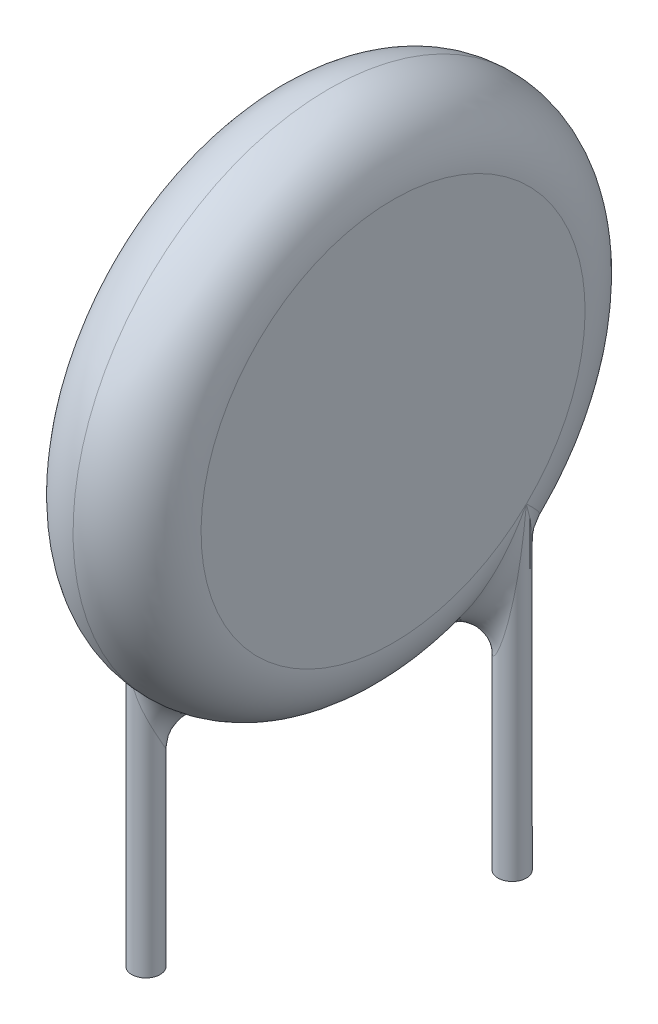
ISO-10303-21;
HEADER;
FILE_DESCRIPTION(('STEP AP214'),'2;1');
FILE_NAME('part.step','',(''),(''),'','','');
FILE_SCHEMA(('AUTOMOTIVE_DESIGN { 1 0 10303 214 1 1 1 1 }'));
ENDSEC;
DATA;
#1=APPLICATION_CONTEXT('core data for automotive mechanical design processes');
#2=APPLICATION_PROTOCOL_DEFINITION('international standard','automotive_design',2000,#1);
#3=PRODUCT_CONTEXT('',#1,'mechanical');
#4=PRODUCT('Part','Part','',(#3));
#5=PRODUCT_RELATED_PRODUCT_CATEGORY('part','',(#4));
#6=PRODUCT_DEFINITION_FORMATION('','',#4);
#7=PRODUCT_DEFINITION_CONTEXT('part definition',#1,'design');
#8=PRODUCT_DEFINITION('design','',#6,#7);
#9=PRODUCT_DEFINITION_SHAPE('','',#8);
#10=(LENGTH_UNIT() NAMED_UNIT(*) SI_UNIT(.MILLI.,.METRE.));
#11=(NAMED_UNIT(*) PLANE_ANGLE_UNIT() SI_UNIT($,.RADIAN.));
#12=(NAMED_UNIT(*) SI_UNIT($,.STERADIAN.) SOLID_ANGLE_UNIT());
#13=UNCERTAINTY_MEASURE_WITH_UNIT(LENGTH_MEASURE(1.E-05),#10,'distance_accuracy_value','');
#14=(GEOMETRIC_REPRESENTATION_CONTEXT(3) GLOBAL_UNCERTAINTY_ASSIGNED_CONTEXT((#13)) GLOBAL_UNIT_ASSIGNED_CONTEXT((#10,
#11,#12)) REPRESENTATION_CONTEXT('',''));
#15=CARTESIAN_POINT('',(0.,0.,0.));
#16=DIRECTION('',(0.,0.,1.));
#17=DIRECTION('',(1.,0.,0.));
#18=AXIS2_PLACEMENT_3D('',#15,#16,#17);
#19=CARTESIAN_POINT('',(82.328191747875,19.5142696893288,-18.0784044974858));
#20=DIRECTION('',(1.,0.,0.));
#21=DIRECTION('',(0.,0.,-1.));
#22=AXIS2_PLACEMENT_3D('',#19,#20,#21);
#23=TOROIDAL_SURFACE('',#22,2.7,0.9);
#24=CARTESIAN_POINT('',(81.428191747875,19.5142696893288,-18.0784044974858));
#25=DIRECTION('',(1.,0.,0.));
#26=DIRECTION('',(0.,0.,-1.));
#27=AXIS2_PLACEMENT_3D('',#24,#25,#26);
#28=CIRCLE('',#27,2.7);
#29=CARTESIAN_POINT('',(81.428191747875,17.5714946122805,-16.2034044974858));
#30=VERTEX_POINT('',#29);
#31=EDGE_CURVE('E87',#30,#30,#28,.F.);
#32=ORIENTED_EDGE('',*,*,#31,.F.);
#33=CARTESIAN_POINT('',(81.428191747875,17.5714946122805,-16.2034044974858));
#34=CARTESIAN_POINT('',(81.428191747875,17.5714946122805,-16.2034044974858));
#35=CARTESIAN_POINT('',(81.428191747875,17.5714946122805,-16.2034044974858));
#36=CARTESIAN_POINT('',(81.4281917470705,17.571481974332,-16.2034199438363));
#37=CARTESIAN_POINT('',(81.4281917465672,17.5714783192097,-16.2034357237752));
#38=CARTESIAN_POINT('',(81.4281917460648,17.5714746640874,-16.2034515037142));
#39=CARTESIAN_POINT('',(81.4281917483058,17.5713253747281,-16.2034258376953));
#40=CARTESIAN_POINT('',(81.4281917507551,17.5713343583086,-16.2034611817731));
#41=CARTESIAN_POINT('',(81.4281917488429,17.5713433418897,-16.2034965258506));
#42=CARTESIAN_POINT('',(81.4281917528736,17.5709759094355,-16.2034468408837));
#43=CARTESIAN_POINT('',(81.4281917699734,17.5710106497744,-16.2035332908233));
#44=CARTESIAN_POINT('',(81.428191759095,17.5710453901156,-16.2036197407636));
#45=CARTESIAN_POINT('',(81.4281917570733,17.5708368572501,-16.2034655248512));
#46=CARTESIAN_POINT('',(81.4281917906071,17.5708786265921,-16.2035821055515));
#47=CARTESIAN_POINT('',(81.4281917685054,17.5709203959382,-16.2036986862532));
#48=CARTESIAN_POINT('',(81.4281917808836,17.5702730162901,-16.2035323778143));
#49=CARTESIAN_POINT('',(81.4281919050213,17.5703460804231,-16.2037626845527));
#50=CARTESIAN_POINT('',(81.4281918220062,17.5704191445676,-16.2039929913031));
#51=CARTESIAN_POINT('',(81.4281918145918,17.5697713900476,-16.2035753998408));
#52=CARTESIAN_POINT('',(81.4281920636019,17.5698774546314,-16.2038912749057));
#53=CARTESIAN_POINT('',(81.4281918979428,17.5699835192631,-16.2042071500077));
#54=CARTESIAN_POINT('',(81.4281919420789,17.5685164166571,-16.2036905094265));
#55=CARTESIAN_POINT('',(81.4281926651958,17.5687027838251,-16.2042275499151));
#56=CARTESIAN_POINT('',(81.4281921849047,17.5688891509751,-16.2047645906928));
#57=CARTESIAN_POINT('',(81.4281920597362,17.567792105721,-16.2037645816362));
#58=CARTESIAN_POINT('',(81.4281932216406,17.568022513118,-16.2044365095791));
#59=CARTESIAN_POINT('',(81.4281924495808,17.5682529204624,-16.205108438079));
#60=CARTESIAN_POINT('',(81.4281923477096,17.5664440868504,-16.2038984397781));
#61=CARTESIAN_POINT('',(81.4281945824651,17.5667578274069,-16.2048176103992));
#62=CARTESIAN_POINT('',(81.4281930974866,17.5670715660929,-16.2057367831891));
#63=CARTESIAN_POINT('',(81.4281925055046,17.5658244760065,-16.2039584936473));
#64=CARTESIAN_POINT('',(81.4281953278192,17.5661770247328,-16.2049899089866));
#65=CARTESIAN_POINT('',(81.4281934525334,17.5665295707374,-16.2060213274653));
#66=CARTESIAN_POINT('',(81.428199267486,17.5431971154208,-16.2061533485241));
#67=CARTESIAN_POINT('',(81.4282272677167,17.5449676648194,-16.2112855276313));
#68=CARTESIAN_POINT('',(81.4282086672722,17.5467390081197,-16.2164175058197));
#69=CARTESIAN_POINT('',(81.4282403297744,17.5214008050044,-16.2083286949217));
#70=CARTESIAN_POINT('',(81.4284212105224,17.5245746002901,-16.2174679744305));
#71=CARTESIAN_POINT('',(81.4283010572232,17.5277577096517,-16.226604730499));
#72=CARTESIAN_POINT('',(81.4283967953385,17.4778395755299,-16.212722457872));
#73=CARTESIAN_POINT('',(81.4291534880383,17.4839360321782,-16.2298968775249));
#74=CARTESIAN_POINT('',(81.4286531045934,17.4900281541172,-16.2470823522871));
#75=CARTESIAN_POINT('',(81.4285120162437,17.4560747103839,-16.2149407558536));
#76=CARTESIAN_POINT('',(81.4296913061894,17.463681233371,-16.2361459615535));
#77=CARTESIAN_POINT('',(81.4289123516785,17.4712794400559,-16.2573724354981));
#78=CARTESIAN_POINT('',(81.4289797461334,17.3905756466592,-16.2217107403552));
#79=CARTESIAN_POINT('',(81.4318621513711,17.4028742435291,-16.2551030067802));
#80=CARTESIAN_POINT('',(81.4299647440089,17.4151442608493,-16.2885771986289));
#81=CARTESIAN_POINT('',(81.4294544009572,17.346977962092,-16.2263442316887));
#82=CARTESIAN_POINT('',(81.4340550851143,17.3626006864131,-16.2679255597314));
#83=CARTESIAN_POINT('',(81.4310327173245,17.3781669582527,-16.3096688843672));
#84=CARTESIAN_POINT('',(81.4308274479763,17.2566472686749,-16.2361750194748));
#85=CARTESIAN_POINT('',(81.4403121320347,17.2797414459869,-16.2947097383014));
#86=CARTESIAN_POINT('',(81.4341220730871,17.3023261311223,-16.3538827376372));
#87=CARTESIAN_POINT('',(81.4317564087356,17.2099392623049,-16.241387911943));
#88=CARTESIAN_POINT('',(81.4445249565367,17.2371425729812,-16.3087097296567));
#89=CARTESIAN_POINT('',(81.4362122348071,17.2635450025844,-16.3770334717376));
#90=CARTESIAN_POINT('',(81.4341080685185,17.117028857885,-16.2519941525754));
#91=CARTESIAN_POINT('',(81.4550319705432,17.1531864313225,-16.3365884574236));
#92=CARTESIAN_POINT('',(81.4415034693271,17.1872159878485,-16.4235409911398));
#93=CARTESIAN_POINT('',(81.4355298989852,17.0708257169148,-16.2573871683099));
#94=CARTESIAN_POINT('',(81.4613505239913,17.1117241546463,-16.3505035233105));
#95=CARTESIAN_POINT('',(81.4447025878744,17.1496660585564,-16.4468973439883));
#96=CARTESIAN_POINT('',(81.4399702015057,16.9509172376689,-16.2716514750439));
#97=CARTESIAN_POINT('',(81.4808632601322,17.0050040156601,-16.3864229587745));
#98=CARTESIAN_POINT('',(81.4546932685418,17.0532061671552,-16.5079283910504));
#99=CARTESIAN_POINT('',(81.4434337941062,16.8775784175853,-16.2806430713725));
#100=CARTESIAN_POINT('',(81.4959611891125,16.9407617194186,-16.4081519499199));
#101=CARTESIAN_POINT('',(81.4624863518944,16.9951971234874,-16.5456705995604));
#102=CARTESIAN_POINT('',(81.4520516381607,16.7336667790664,-16.2986553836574));
#103=CARTESIAN_POINT('',(81.532376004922,16.8181241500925,-16.4486929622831));
#104=CARTESIAN_POINT('',(81.4818765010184,16.8830904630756,-16.6199459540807));
#105=CARTESIAN_POINT('',(81.4571760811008,16.6630681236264,-16.3076729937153));
#106=CARTESIAN_POINT('',(81.5538899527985,16.7592352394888,-16.4676619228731));
#107=CARTESIAN_POINT('',(81.4934064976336,16.8289430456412,-16.656488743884));
#108=CARTESIAN_POINT('',(81.4660361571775,16.5628541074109,-16.3205725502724));
#109=CARTESIAN_POINT('',(81.5892970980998,16.679804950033,-16.4914108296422));
#110=CARTESIAN_POINT('',(81.5133416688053,16.7531380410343,-16.7079939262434));
#111=CARTESIAN_POINT('',(81.4689441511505,16.5324133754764,-16.3245044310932));
#112=CARTESIAN_POINT('',(81.6009206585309,16.6558851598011,-16.4982863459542));
#113=CARTESIAN_POINT('',(81.5198846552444,16.7302560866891,-16.7235888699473));
#114=CARTESIAN_POINT('',(81.475202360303,16.4719042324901,-16.3323206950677));
#115=CARTESIAN_POINT('',(81.6254944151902,16.6094244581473,-16.5109051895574));
#116=CARTESIAN_POINT('',(81.5339656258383,16.6850417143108,-16.7544089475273));
#117=CARTESIAN_POINT('',(81.4785538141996,16.4418371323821,-16.3362049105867));
#118=CARTESIAN_POINT('',(81.6384917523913,16.5868713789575,-16.5166368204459));
#119=CARTESIAN_POINT('',(81.5415063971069,16.6627110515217,-16.7696328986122));
#120=CARTESIAN_POINT('',(81.4895473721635,16.3505306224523,-16.3479572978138));
#121=CARTESIAN_POINT('',(81.6806704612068,16.5197625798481,-16.5321166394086));
#122=CARTESIAN_POINT('',(81.5662419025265,16.5952882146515,-16.815456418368));
#123=CARTESIAN_POINT('',(81.4979627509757,16.2901374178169,-16.3556703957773));
#124=CARTESIAN_POINT('',(81.7118327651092,16.4786500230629,-16.5392072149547));
#125=CARTESIAN_POINT('',(81.5851765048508,16.5512391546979,-16.845193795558));
#126=CARTESIAN_POINT('',(81.5171612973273,16.1726872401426,-16.3701901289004));
#127=CARTESIAN_POINT('',(81.7774099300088,16.4073260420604,-16.5440593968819));
#128=CARTESIAN_POINT('',(81.6283732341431,16.4665119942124,-16.900860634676));
#129=CARTESIAN_POINT('',(81.527943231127,16.1156285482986,-16.376997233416));
#130=CARTESIAN_POINT('',(81.812265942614,16.3773830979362,-16.5413576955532));
#131=CARTESIAN_POINT('',(81.6526325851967,16.4258321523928,-16.9267920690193));
#132=CARTESIAN_POINT('',(81.552161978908,16.007099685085,-16.38887442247));
#133=CARTESIAN_POINT('',(81.8789277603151,16.3338759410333,-16.5229627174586));
#134=CARTESIAN_POINT('',(81.7071247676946,16.3492911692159,-16.9722776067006));
#135=CARTESIAN_POINT('',(81.5655681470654,15.9555747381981,-16.3939628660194));
#136=CARTESIAN_POINT('',(81.9108328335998,16.32100432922,-16.5065138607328));
#137=CARTESIAN_POINT('',(81.7372886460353,16.3133817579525,-16.9918989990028));
#138=CARTESIAN_POINT('',(81.588411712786,15.8825866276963,-16.3995807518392));
#139=CARTESIAN_POINT('',(81.946451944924,16.3169453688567,-16.4719771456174));
#140=CARTESIAN_POINT('',(81.7886866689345,16.2631357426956,-17.0145703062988));
#141=CARTESIAN_POINT('',(81.5968348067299,15.8582043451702,-16.4011305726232));
#142=CARTESIAN_POINT('',(81.9564078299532,16.3187998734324,-16.4576354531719));
#143=CARTESIAN_POINT('',(81.807638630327,16.2464784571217,-17.0210906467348));
#144=CARTESIAN_POINT('',(81.6144895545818,15.8125170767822,-16.4031324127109));
#145=CARTESIAN_POINT('',(81.967768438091,16.328289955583,-16.4268355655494));
#146=CARTESIAN_POINT('',(81.8473618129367,16.2155368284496,-17.0304955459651));
#147=CARTESIAN_POINT('',(81.623722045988,15.7912153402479,-16.4035832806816));
#148=CARTESIAN_POINT('',(81.9688082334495,16.3361435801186,-16.4103431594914));
#149=CARTESIAN_POINT('',(81.8681349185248,16.2012549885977,-17.0333762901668));
#150=CARTESIAN_POINT('',(81.6429427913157,15.7524083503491,-16.4030935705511));
#151=CARTESIAN_POINT('',(81.9590607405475,16.3556142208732,-16.3787756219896));
#152=CARTESIAN_POINT('',(81.9113815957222,16.1755715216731,-17.0346180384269));
#153=CARTESIAN_POINT('',(81.6529385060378,15.734949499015,-16.402136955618));
#154=CARTESIAN_POINT('',(81.9477399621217,16.3673315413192,-16.3639033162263));
#155=CARTESIAN_POINT('',(81.9338719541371,16.1642048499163,-17.0329267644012));
#156=CARTESIAN_POINT('',(81.6732436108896,15.7051550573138,-16.3985351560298));
#157=CARTESIAN_POINT('',(81.9132191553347,16.3894074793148,-16.3416156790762));
#158=CARTESIAN_POINT('',(81.9795584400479,16.1452786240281,-17.0240947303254));
#159=CARTESIAN_POINT('',(81.6835523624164,15.6928097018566,-16.3958932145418));
#160=CARTESIAN_POINT('',(81.889931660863,16.3995931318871,-16.3345305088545));
#161=CARTESIAN_POINT('',(82.0027531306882,16.1377118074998,-17.0169644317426));
#162=CARTESIAN_POINT('',(81.7024856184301,15.6752879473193,-16.3893231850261));
#163=CARTESIAN_POINT('',(81.8421420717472,16.4118593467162,-16.3319849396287));
#164=CARTESIAN_POINT('',(82.0453529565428,16.127653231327,-16.9983778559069));
#165=CARTESIAN_POINT('',(81.7111359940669,15.6693272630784,-16.3856396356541));
#166=CARTESIAN_POINT('',(81.8185129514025,16.4147770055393,-16.3350972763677));
#167=CARTESIAN_POINT('',(82.06481630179,16.1245811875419,-16.9877065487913));
#168=CARTESIAN_POINT('',(81.7279459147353,15.6616950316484,-16.3770082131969));
#169=CARTESIAN_POINT('',(81.7743676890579,16.4139909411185,-16.348588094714));
#170=CARTESIAN_POINT('',(82.1026386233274,16.1216183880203,-16.9623123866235));
#171=CARTESIAN_POINT('',(81.7361055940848,15.6600223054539,-16.3720606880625));
#172=CARTESIAN_POINT('',(81.7541131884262,16.4102972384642,-16.3588800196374));
#173=CARTESIAN_POINT('',(82.1209979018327,16.1217267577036,-16.9475906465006));
#174=CARTESIAN_POINT('',(81.7507601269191,15.6606447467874,-16.3616718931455));
#175=CARTESIAN_POINT('',(81.7235053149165,16.3986613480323,-16.381358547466));
#176=CARTESIAN_POINT('',(82.1539706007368,16.1247586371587,-16.9164383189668));
#177=CARTESIAN_POINT('',(81.757339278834,15.6625210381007,-16.3563459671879));
#178=CARTESIAN_POINT('',(81.7123737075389,16.3913277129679,-16.393082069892));
#179=CARTESIAN_POINT('',(82.1687736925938,16.1273690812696,-16.900377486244));
#180=CARTESIAN_POINT('',(81.7697194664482,15.6690573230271,-16.3449709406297));
#181=CARTESIAN_POINT('',(81.6974033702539,16.3750450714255,-16.4159493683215));
#182=CARTESIAN_POINT('',(82.1966291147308,16.1346961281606,-16.8659364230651));
#183=CARTESIAN_POINT('',(81.7755191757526,15.6737219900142,-16.3389206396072));
#184=CARTESIAN_POINT('',(81.6934981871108,16.3661653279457,-16.4270380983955));
#185=CARTESIAN_POINT('',(82.2096784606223,16.1394162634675,-16.8475523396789));
#186=CARTESIAN_POINT('',(81.7923347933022,15.6920718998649,-16.3190314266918));
#187=CARTESIAN_POINT('',(81.6912652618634,16.3396648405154,-16.456770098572));
#188=CARTESIAN_POINT('',(82.2475136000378,16.1570911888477,-16.7869653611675));
#189=CARTESIAN_POINT('',(81.8017962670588,15.7099856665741,-16.304149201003));
#190=CARTESIAN_POINT('',(81.7033188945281,16.3230027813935,-16.4706632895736));
#191=CARTESIAN_POINT('',(82.2688019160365,16.1733106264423,-16.7414188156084));
#192=CARTESIAN_POINT('',(81.8133786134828,15.7436575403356,-16.2796207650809));
#193=CARTESIAN_POINT('',(81.7311702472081,16.3066762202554,-16.4779049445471));
#194=CARTESIAN_POINT('',(82.2948621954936,16.2032975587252,-16.6662061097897));
#195=CARTESIAN_POINT('',(81.8169184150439,15.7572809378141,-16.2703335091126));
#196=CARTESIAN_POINT('',(81.7430950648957,16.3027684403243,-16.477549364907));
#197=CARTESIAN_POINT('',(82.3028267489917,16.2153376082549,-16.6376977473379));
#198=CARTESIAN_POINT('',(81.8233248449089,15.790178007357,-16.2489844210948));
#199=CARTESIAN_POINT('',(81.7709266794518,16.2986776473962,-16.4710164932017));
#200=CARTESIAN_POINT('',(82.317241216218,16.2443263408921,-16.5721327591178));
#201=CARTESIAN_POINT('',(81.8257500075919,15.8099830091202,-16.2368519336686));
#202=CARTESIAN_POINT('',(81.787155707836,16.2995655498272,-16.4634955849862));
#203=CARTESIAN_POINT('',(82.3226978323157,16.2617216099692,-16.534850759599));
#204=CARTESIAN_POINT('',(81.8283554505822,15.8514627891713,-16.2125862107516));
#205=CARTESIAN_POINT('',(81.817561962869,16.3071067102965,-16.4427432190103));
#206=CARTESIAN_POINT('',(82.3285600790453,16.2981478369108,-16.4602807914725));
#207=CARTESIAN_POINT('',(81.8285297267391,15.8731424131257,-16.200453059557));
#208=CARTESIAN_POINT('',(81.8318453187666,16.3136176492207,-16.4296304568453));
#209=CARTESIAN_POINT('',(82.3289522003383,16.3171830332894,-16.4229930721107));
#210=CARTESIAN_POINT('',(81.8267453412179,15.9176162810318,-16.1765982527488));
#211=CARTESIAN_POINT('',(81.8568523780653,16.3308938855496,-16.4001284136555));
#212=CARTESIAN_POINT('',(82.3249373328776,16.3562312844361,-16.3496822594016));
#213=CARTESIAN_POINT('',(81.8247976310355,15.9404042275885,-16.16487480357));
#214=CARTESIAN_POINT('',(81.8677201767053,16.3415576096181,-16.3837930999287));
#215=CARTESIAN_POINT('',(82.3205549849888,16.3762388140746,-16.3136536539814));
#216=CARTESIAN_POINT('',(81.8189217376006,15.9868379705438,-16.1420796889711));
#217=CARTESIAN_POINT('',(81.8856133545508,16.3659245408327,-16.3494782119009));
#218=CARTESIAN_POINT('',(82.3073342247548,16.4169437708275,-16.2435612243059));
#219=CARTESIAN_POINT('',(81.8149927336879,16.0104841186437,-16.1310082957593));
#220=CARTESIAN_POINT('',(81.8927447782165,16.3795999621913,-16.3314828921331));
#221=CARTESIAN_POINT('',(82.2984939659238,16.4376414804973,-16.209498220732));
#222=CARTESIAN_POINT('',(81.8049273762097,16.0604204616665,-16.108941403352));
#223=CARTESIAN_POINT('',(81.9036538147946,16.4102473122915,-16.2935526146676));
#224=CARTESIAN_POINT('',(82.2758469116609,16.4811742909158,-16.1414789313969));
#225=CARTESIAN_POINT('',(81.7986360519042,16.0867681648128,-16.0980270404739));
#226=CARTESIAN_POINT('',(81.907213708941,16.4274166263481,-16.2735095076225));
#227=CARTESIAN_POINT('',(82.2616914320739,16.5040451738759,-16.1077618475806));
#228=CARTESIAN_POINT('',(81.7842118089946,16.1401781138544,-16.0776520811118));
#229=CARTESIAN_POINT('',(81.9102058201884,16.4634150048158,-16.2338740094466));
#230=CARTESIAN_POINT('',(82.2292368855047,16.5500478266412,-16.0445103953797));
#231=CARTESIAN_POINT('',(81.7760780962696,16.1672406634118,-16.0681921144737));
#232=CARTESIAN_POINT('',(81.9097089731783,16.4822476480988,-16.2142399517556));
#233=CARTESIAN_POINT('',(82.2109360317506,16.5731797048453,-16.0149778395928));
#234=CARTESIAN_POINT('',(81.7578721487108,16.2234654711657,-16.0505942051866));
#235=CARTESIAN_POINT('',(81.904799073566,16.5220284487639,-16.1751923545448));
#236=CARTESIAN_POINT('',(82.1699726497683,16.6207131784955,-15.9594858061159));
#237=CARTESIAN_POINT('',(81.7477240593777,16.2526654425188,-16.0425445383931));
#238=CARTESIAN_POINT('',(81.90025514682,16.5430504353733,-16.1557828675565));
#239=CARTESIAN_POINT('',(82.1471394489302,16.6451211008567,-15.9337745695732));
#240=CARTESIAN_POINT('',(81.7262323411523,16.3119640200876,-16.0286128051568));
#241=CARTESIAN_POINT('',(81.8873359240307,16.586107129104,-16.1188937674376));
#242=CARTESIAN_POINT('',(82.0987830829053,16.6939889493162,-15.8883217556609));
#243=CARTESIAN_POINT('',(81.7148887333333,16.3420626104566,-16.0227307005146));
#244=CARTESIAN_POINT('',(81.8790164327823,16.6081331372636,-16.101379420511));
#245=CARTESIAN_POINT('',(82.0732599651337,16.7184488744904,-15.8685800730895));
#246=CARTESIAN_POINT('',(81.6909671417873,16.4046044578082,-16.0130549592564));
#247=CARTESIAN_POINT('',(81.8584955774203,16.6541160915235,-16.0682075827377));
#248=CARTESIAN_POINT('',(82.0194363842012,16.768481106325,-15.8345778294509));
#249=CARTESIAN_POINT('',(81.67835674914,16.4370925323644,-16.0093652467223));
#250=CARTESIAN_POINT('',(81.8461884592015,16.678114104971,-16.0526145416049));
#251=CARTESIAN_POINT('',(81.9910630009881,16.7940547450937,-15.8205984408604));
#252=CARTESIAN_POINT('',(81.652887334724,16.5032224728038,-16.0045113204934));
#253=CARTESIAN_POINT('',(81.8184093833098,16.727204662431,-16.0249423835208));
#254=CARTESIAN_POINT('',(81.9337568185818,16.8452417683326,-15.7993722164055));
#255=CARTESIAN_POINT('',(81.6400280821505,16.5368654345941,-16.0033495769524));
#256=CARTESIAN_POINT('',(81.8029834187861,16.7522791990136,-16.0128153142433));
#257=CARTESIAN_POINT('',(81.9048235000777,16.8708551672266,-15.7921319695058));
#258=CARTESIAN_POINT('',(81.6137949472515,16.6073627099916,-16.0034668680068));
#259=CARTESIAN_POINT('',(81.7688058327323,16.8051205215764,-15.9921265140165));
#260=CARTESIAN_POINT('',(81.8457989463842,16.9236616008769,-15.7838385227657));
#261=CARTESIAN_POINT('',(81.6004374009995,16.6442878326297,-16.0048988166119));
#262=CARTESIAN_POINT('',(81.7499313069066,16.832965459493,-15.9837451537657));
#263=CARTESIAN_POINT('',(81.8157444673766,16.9508558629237,-15.7831888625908));
#264=CARTESIAN_POINT('',(81.5745762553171,16.7192094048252,-16.0102739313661));
#265=CARTESIAN_POINT('',(81.7108660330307,16.889902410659,-15.972200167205));
#266=CARTESIAN_POINT('',(81.7575568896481,17.005164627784,-15.788485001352));
#267=CARTESIAN_POINT('',(81.5620701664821,16.7572022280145,-16.0142093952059));
#268=CARTESIAN_POINT('',(81.6906919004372,16.9189822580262,-15.9689408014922));
#269=CARTESIAN_POINT('',(81.7294181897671,17.0322791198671,-15.7944106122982));
#270=CARTESIAN_POINT('',(81.5374159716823,16.8370570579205,-16.0246538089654));
#271=CARTESIAN_POINT('',(81.6488887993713,16.9805664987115,-15.9676818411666));
#272=CARTESIAN_POINT('',(81.6739462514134,17.0884722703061,-15.8126689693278));
#273=CARTESIAN_POINT('',(81.5253599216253,16.8789996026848,-16.0313289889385));
#274=CARTESIAN_POINT('',(81.6272153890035,17.0132115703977,-15.9699922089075));
#275=CARTESIAN_POINT('',(81.6468201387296,17.1175504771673,-15.8254360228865));
#276=CARTESIAN_POINT('',(81.5028766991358,16.964601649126,-16.0469240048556));
#277=CARTESIAN_POINT('',(81.5851912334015,17.0803649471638,-15.9805014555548));
#278=CARTESIAN_POINT('',(81.5962328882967,17.1761306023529,-15.8567679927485));
#279=CARTESIAN_POINT('',(81.4924777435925,17.0082777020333,-16.0558771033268));
#280=CARTESIAN_POINT('',(81.5648034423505,17.114939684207,-15.9887209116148));
#281=CARTESIAN_POINT('',(81.5728352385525,17.2056320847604,-15.8754199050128));
#282=CARTESIAN_POINT('',(81.4779680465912,17.0769353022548,-16.0711549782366));
#283=CARTESIAN_POINT('',(81.5354970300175,17.1697759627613,-16.005593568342));
#284=CARTESIAN_POINT('',(81.5401884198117,17.2515017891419,-15.9079855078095));
#285=CARTESIAN_POINT('',(81.4731102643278,17.1016418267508,-16.0768909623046));
#286=CARTESIAN_POINT('',(81.5255158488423,17.1895435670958,-16.0124146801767));
#287=CARTESIAN_POINT('',(81.529258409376,17.2679079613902,-15.9203464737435));
#288=CARTESIAN_POINT('',(81.464092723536,17.1513317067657,-16.0888292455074));
#289=CARTESIAN_POINT('',(81.5067419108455,17.2294243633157,-16.027488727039));
#290=CARTESIAN_POINT('',(81.5089689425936,17.3007260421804,-15.9462983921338));
#291=CARTESIAN_POINT('',(81.4599341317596,17.1763154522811,-16.0950322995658));
#292=CARTESIAN_POINT('',(81.4979370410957,17.249551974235,-16.0357419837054));
#293=CARTESIAN_POINT('',(81.49961211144,17.3171379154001,-15.9598913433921));
#294=CARTESIAN_POINT('',(81.4525854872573,17.2249619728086,-16.1074293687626));
#295=CARTESIAN_POINT('',(81.4822139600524,17.288847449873,-16.0529343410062));
#296=CARTESIAN_POINT('',(81.4830776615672,17.3489435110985,-15.9872326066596));
#297=CARTESIAN_POINT('',(81.4493521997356,17.2486137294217,-16.1136014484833));
#298=CARTESIAN_POINT('',(81.4752046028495,17.3080085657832,-16.0618014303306));
#299=CARTESIAN_POINT('',(81.4758027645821,17.3643390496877,-16.0009223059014));
#300=CARTESIAN_POINT('',(81.4435760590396,17.2959100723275,-16.1261737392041));
#301=CARTESIAN_POINT('',(81.4625891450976,17.3463944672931,-16.0803654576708));
#302=CARTESIAN_POINT('',(81.4628064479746,17.3950092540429,-16.0289353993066));
#303=CARTESIAN_POINT('',(81.4410290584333,17.3195537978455,-16.1325723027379));
#304=CARTESIAN_POINT('',(81.4569648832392,17.3656321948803,-16.0900608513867));
#305=CARTESIAN_POINT('',(81.4570756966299,17.4102840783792,-16.0432543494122));
#306=CARTESIAN_POINT('',(81.4372965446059,17.3596145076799,-16.1435587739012));
#307=CARTESIAN_POINT('',(81.4486761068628,17.3982809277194,-16.1070330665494));
#308=CARTESIAN_POINT('',(81.4486775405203,17.4360853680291,-16.0679243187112));
#309=CARTESIAN_POINT('',(81.4359335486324,17.3760061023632,-16.1480949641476));
#310=CARTESIAN_POINT('',(81.4456332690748,17.4116513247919,-16.1141285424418));
#311=CARTESIAN_POINT('',(81.4456107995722,17.4466200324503,-16.0781336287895));
#312=CARTESIAN_POINT('',(81.4335106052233,17.4091602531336,-16.1573337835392));
#313=CARTESIAN_POINT('',(81.4402081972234,17.4387116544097,-16.1287210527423));
#314=CARTESIAN_POINT('',(81.4401591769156,17.4678903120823,-16.0989655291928));
#315=CARTESIAN_POINT('',(81.4324572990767,17.4259236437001,-16.1620379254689));
#316=CARTESIAN_POINT('',(81.4378380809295,17.4524087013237,-16.1362262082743));
#317=CARTESIAN_POINT('',(81.4377892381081,17.4786257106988,-16.1095923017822));
#318=CARTESIAN_POINT('',(81.4304473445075,17.4641652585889,-16.1728252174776));
#319=CARTESIAN_POINT('',(81.4333077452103,17.4836609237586,-16.1535543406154));
#320=CARTESIAN_POINT('',(81.4332668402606,17.5030798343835,-16.1339979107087));
#321=CARTESIAN_POINT('',(81.4296000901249,17.4856510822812,-16.1789261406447));
#322=CARTESIAN_POINT('',(81.431387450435,17.5012413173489,-16.1634478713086));
#323=CARTESIAN_POINT('',(81.4313605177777,17.5167933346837,-16.1478272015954));
#324=CARTESIAN_POINT('',(81.4287741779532,17.5171407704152,-16.1878883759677));
#325=CARTESIAN_POINT('',(81.4295143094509,17.5270128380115,-16.1780436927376));
#326=CARTESIAN_POINT('',(81.4295022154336,17.5368740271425,-16.1681605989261));
#327=CARTESIAN_POINT('',(81.4285733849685,17.5271204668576,-16.1907317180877));
#328=CARTESIAN_POINT('',(81.4290585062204,17.5351808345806,-16.1826832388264));
#329=CARTESIAN_POINT('',(81.4290504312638,17.5432353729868,-16.1746141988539));
#330=CARTESIAN_POINT('',(81.4282943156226,17.5469627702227,-16.196401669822));
#331=CARTESIAN_POINT('',(81.4284248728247,17.5514165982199,-16.1919490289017));
#332=CARTESIAN_POINT('',(81.428422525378,17.5558713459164,-16.1874956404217));
#333=CARTESIAN_POINT('',(81.4282152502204,17.5568257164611,-16.1992282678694));
#334=CARTESIAN_POINT('',(81.4282451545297,17.5594859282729,-16.1965758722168));
#335=CARTESIAN_POINT('',(81.4282446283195,17.5621462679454,-16.1939233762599));
#336=CARTESIAN_POINT('',(81.4281953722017,17.5672569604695,-16.2021934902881));
#337=CARTESIAN_POINT('',(81.4281999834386,17.5680269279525,-16.2014229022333));
#338=CARTESIAN_POINT('',(81.4281999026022,17.5687968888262,-16.2006522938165));
#339=CARTESIAN_POINT('',(81.4281946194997,17.5677201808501,-16.2023251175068));
#340=CARTESIAN_POINT('',(81.4281982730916,17.568406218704,-16.2016380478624));
#341=CARTESIAN_POINT('',(81.4281982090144,17.569092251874,-16.2009509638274));
#342=CARTESIAN_POINT('',(81.4281932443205,17.5687223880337,-16.2026142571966));
#343=CARTESIAN_POINT('',(81.4281951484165,17.5692254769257,-16.2021120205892));
#344=CARTESIAN_POINT('',(81.4281951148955,17.5697285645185,-16.2016097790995));
#345=CARTESIAN_POINT('',(81.428192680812,17.5692572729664,-16.2027715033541));
#346=CARTESIAN_POINT('',(81.4281938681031,17.5696618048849,-16.2023706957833));
#347=CARTESIAN_POINT('',(81.4281938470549,17.5700663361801,-16.201969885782));
#348=CARTESIAN_POINT('',(81.428192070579,17.5702066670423,-16.2030328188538));
#349=CARTESIAN_POINT('',(81.4281924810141,17.5704418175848,-16.2027951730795));
#350=CARTESIAN_POINT('',(81.4281924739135,17.5706769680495,-16.2025575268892));
#351=CARTESIAN_POINT('',(81.4281919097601,17.5705924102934,-16.2031350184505));
#352=CARTESIAN_POINT('',(81.4281921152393,17.5707599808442,-16.2029598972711));
#353=CARTESIAN_POINT('',(81.4281921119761,17.5709275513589,-16.2027847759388));
#354=CARTESIAN_POINT('',(81.4281917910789,17.5709969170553,-16.2032665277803));
#355=CARTESIAN_POINT('',(81.4281918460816,17.5710860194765,-16.2031800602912));
#356=CARTESIAN_POINT('',(81.4281918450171,17.5711751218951,-16.2030935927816));
#357=CARTESIAN_POINT('',(81.4281917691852,17.5710931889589,-16.2033009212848));
#358=CARTESIAN_POINT('',(81.4281917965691,17.5711626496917,-16.2032384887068));
#359=CARTESIAN_POINT('',(81.4281917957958,17.5712321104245,-16.2031760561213));
#360=CARTESIAN_POINT('',(81.4281917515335,17.5713754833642,-16.2033639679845));
#361=CARTESIAN_POINT('',(81.4281917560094,17.5713991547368,-16.2033361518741));
#362=CARTESIAN_POINT('',(81.4281917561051,17.5714228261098,-16.2033083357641));
#363=CARTESIAN_POINT('',(81.4281917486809,17.5715072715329,-16.2033890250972));
#364=CARTESIAN_POINT('',(81.4281917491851,17.5715109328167,-16.2033732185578));
#365=CARTESIAN_POINT('',(81.4281917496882,17.5715145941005,-16.2033574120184));
#366=CARTESIAN_POINT('',(81.428191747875,17.5714946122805,-16.2034044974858));
#367=CARTESIAN_POINT('',(81.428191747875,17.5714946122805,-16.2034044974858));
#368=CARTESIAN_POINT('',(81.428191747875,17.5714946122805,-16.2034044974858));
#369=(BOUNDED_SURFACE() B_SPLINE_SURFACE(3,2,((#33,#34,#35),(#36,#37,#38),(#39,#40,#41),(#42,
#43,#44),(#45,#46,#47),(#48,#49,#50),(#51,#52,#53),(#54,#55,#56),(#57,#58,#59),(#60,#61,#62),
(#63,#64,#65),(#66,#67,#68),(#69,#70,#71),(#72,#73,#74),(#75,#76,#77),(#78,#79,#80),(#81,#82,
#83),(#84,#85,#86),(#87,#88,#89),(#90,#91,#92),(#93,#94,#95),(#96,#97,#98),(#99,#100,#101),
(#102,#103,#104),(#105,#106,#107),(#108,#109,#110),(#111,#112,#113),(#114,#115,#116),(#117,#118,
#119),(#120,#121,#122),(#123,#124,#125),(#126,#127,#128),(#129,#130,#131),(#132,#133,#134),
(#135,#136,#137),(#138,#139,#140),(#141,#142,#143),(#144,#145,#146),(#147,#148,#149),(#150,#151,
#152),(#153,#154,#155),(#156,#157,#158),(#159,#160,#161),(#162,#163,#164),(#165,#166,#167),
(#168,#169,#170),(#171,#172,#173),(#174,#175,#176),(#177,#178,#179),(#180,#181,#182),(#183,#184,
#185),(#186,#187,#188),(#189,#190,#191),(#192,#193,#194),(#195,#196,#197),(#198,#199,#200),
(#201,#202,#203),(#204,#205,#206),(#207,#208,#209),(#210,#211,#212),(#213,#214,#215),(#216,#217,
#218),(#219,#220,#221),(#222,#223,#224),(#225,#226,#227),(#228,#229,#230),(#231,#232,#233),
(#234,#235,#236),(#237,#238,#239),(#240,#241,#242),(#243,#244,#245),(#246,#247,#248),(#249,#250,
#251),(#252,#253,#254),(#255,#256,#257),(#258,#259,#260),(#261,#262,#263),(#264,#265,#266),
(#267,#268,#269),(#270,#271,#272),(#273,#274,#275),(#276,#277,#278),(#279,#280,#281),(#282,#283,
#284),(#285,#286,#287),(#288,#289,#290),(#291,#292,#293),(#294,#295,#296),(#297,#298,#299),
(#300,#301,#302),(#303,#304,#305),(#306,#307,#308),(#309,#310,#311),(#312,#313,#314),(#315,#316,
#317),(#318,#319,#320),(#321,#322,#323),(#324,#325,#326),(#327,#328,#329),(#330,#331,#332),
(#333,#334,#335),(#336,#337,#338),(#339,#340,#341),(#342,#343,#344),(#345,#346,#347),(#348,#349,
#350),(#351,#352,#353),(#354,#355,#356),(#357,#358,#359),(#360,#361,#362),(#363,#364,#365),
(#366,#367,#368)),.UNSPECIFIED.,.T.,.F.,.F.) B_SPLINE_SURFACE_WITH_KNOTS((4,2,2,2,2,2,2,2,2,2,2,
2,2,2,2,2,2,2,2,2,2,2,2,2,2,2,2,2,2,2,2,2,2,2,2,2,2,2,2,2,2,2,2,2,2,2,2,2,2,2,2,2,2,2,2,4),(3,
3),(0.,0.000314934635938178,0.000854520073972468,0.00233120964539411,0.00469172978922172,
0.00664667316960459,0.0761029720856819,0.145389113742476,0.285040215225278,0.435746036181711,
0.58618761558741,0.828140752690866,1.06597181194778,1.17070786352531,1.27574290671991,
1.49245418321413,1.7090527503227,1.9232584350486,2.03884779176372,2.15455819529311,
2.2715972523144,2.38841176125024,2.48814605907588,2.58785293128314,2.67651868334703,
2.76533345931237,2.95499198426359,3.06678126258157,3.20882526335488,3.35124808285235,
3.49293933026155,3.63468931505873,3.78809788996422,3.94157271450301,4.10262117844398,
4.2636668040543,4.43183819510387,4.60017383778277,4.77875863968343,4.95679664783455,
5.14777247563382,5.341715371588,5.44988425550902,5.55823188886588,5.66005707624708,
5.76125235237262,5.83116560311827,5.90248398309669,5.99374559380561,6.03604593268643,
6.0780709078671,6.08002283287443,6.08237774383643,6.08386066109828,6.08440213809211,
6.08471760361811),(0.,1.),
.UNSPECIFIED.) GEOMETRIC_REPRESENTATION_ITEM() RATIONAL_B_SPLINE_SURFACE(((1.,1.,1.),(1.,1.,1.),
(1.,0.999999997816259,1.),(1.,0.999999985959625,1.),(1.,0.999999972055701,1.),(1.,
0.99999989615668,1.),(1.,0.999999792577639,1.),(1.,0.999999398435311,1.),(1.,0.999999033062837,
1.),(1.,0.99999814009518,1.),(1.,0.999997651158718,1.),(1.,0.999976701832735,1.),(1.,
0.999849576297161,1.),(1.,0.999371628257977,1.),(1.,0.99902135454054,1.),(1.,0.997612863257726,
1.),(1.,0.996196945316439,1.),(1.,0.992183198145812,1.),(1.,0.989500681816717,1.),(1.,
0.982850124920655,1.),(1.,0.978884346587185,1.),(1.,0.966747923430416,1.),(1.,0.957486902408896,
1.),(1.,0.935270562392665,1.),(1.,0.922380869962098,1.),(1.,0.900948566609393,1.),(1.,
0.894009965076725,1.),(1.,0.879330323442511,1.),(1.,0.871587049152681,1.),(1.,0.846644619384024,
1.),(1.,0.828145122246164,1.),(1.,0.787988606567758,1.),(1.,0.766333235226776,1.),(1.,
0.720958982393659,1.),(1.,0.697265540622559,1.),(1.,0.661230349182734,1.),(1.,0.648684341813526,
1.),(1.,0.624575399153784,1.),(1.,0.613013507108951,1.),(1.,0.59190744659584,1.),(1.,
0.58238797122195,1.),(1.,0.566918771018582,1.),(1.,0.560962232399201,1.),(1.,0.554103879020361,
1.),(1.,0.552590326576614,1.),(1.,0.552883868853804,1.),(1.,0.554690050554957,1.),(1.,
0.560741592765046,1.),(1.,0.564694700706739,1.),(1.,0.574232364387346,1.),(1.,0.57981965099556,
1.),(1.,0.598936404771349,1.),(1.,0.614280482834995,1.),(1.,0.638702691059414,1.),(1.,
0.647766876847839,1.),(1.,0.667926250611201,1.),(1.,0.678907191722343,1.),(1.,0.699766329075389,
1.),(1.,0.709641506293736,1.),(1.,0.72812407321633,1.),(1.,0.736737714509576,1.),(1.,
0.752868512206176,1.),(1.,0.760385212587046,1.),(1.,0.775129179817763,1.),(1.,0.782281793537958,
1.),(1.,0.795903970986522,1.),(1.,0.802373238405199,1.),(1.,0.815256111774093,1.),(1.,
0.821651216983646,1.),(1.,0.834312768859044,1.),(1.,0.840579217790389,1.),(1.,0.853416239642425,
1.),(1.,0.859988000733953,1.),(1.,0.873197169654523,1.),(1.,0.879834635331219,1.),(1.,
0.89349224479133,1.),(1.,0.900511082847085,1.),(1.,0.914314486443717,1.),(1.,0.921099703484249,
1.),(1.,0.934709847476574,1.),(1.,0.941501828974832,1.),(1.,0.954395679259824,1.),(1.,
0.960485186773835,1.),(1.,0.969117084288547,1.),(1.,0.972037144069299,1.),(1.,0.97750292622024,
1.),(1.,0.980048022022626,1.),(1.,0.98457871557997,1.),(1.,0.986588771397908,1.),(1.,
0.990201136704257,1.),(1.,0.991805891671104,1.),(1.,0.994168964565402,1.),(1.,0.995035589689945,
1.),(1.,0.996580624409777,1.),(1.,0.997254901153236,1.),(1.,0.998544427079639,1.),(1.,
0.999090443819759,1.),(1.,0.999623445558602,1.),(1.,0.999753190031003,1.),(1.,0.999933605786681,
1.),(1.,0.999984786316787,1.),(1.,0.999997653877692,1.),(1.,0.999998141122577,1.),(1.,
0.999999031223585,1.),(1.,0.999999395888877,1.),(1.,0.999999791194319,1.),(1.,0.999999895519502,
1.),(1.,0.999999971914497,1.),(1.,0.99999998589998,1.),(1.,0.999999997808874,1.),(1.,
0.999999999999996,1.),(1.,1.,1.))) REPRESENTATION_ITEM('') SURFACE());
#370=CARTESIAN_POINT('',(81.428191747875,17.5714946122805,-16.2034044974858));
#371=CARTESIAN_POINT('',(81.4281917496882,17.5715145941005,-16.2033574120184));
#372=CARTESIAN_POINT('',(81.4281917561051,17.5714228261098,-16.2033083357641));
#373=CARTESIAN_POINT('',(81.4281917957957,17.5712321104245,-16.2031760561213));
#374=CARTESIAN_POINT('',(81.4281918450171,17.5711751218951,-16.2030935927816));
#375=CARTESIAN_POINT('',(81.4281921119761,17.5709275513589,-16.2027847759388));
#376=CARTESIAN_POINT('',(81.4281924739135,17.5706769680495,-16.2025575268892));
#377=CARTESIAN_POINT('',(81.4281938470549,17.5700663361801,-16.201969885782));
#378=CARTESIAN_POINT('',(81.4281951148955,17.5697285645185,-16.2016097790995));
#379=CARTESIAN_POINT('',(81.4281982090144,17.569092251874,-16.2009509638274));
#380=CARTESIAN_POINT('',(81.4281999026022,17.5687968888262,-16.2006522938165));
#381=CARTESIAN_POINT('',(81.4282446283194,17.5621462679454,-16.19392337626));
#382=CARTESIAN_POINT('',(81.428422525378,17.5558713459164,-16.1874956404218));
#383=CARTESIAN_POINT('',(81.4290504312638,17.5432353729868,-16.1746141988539));
#384=CARTESIAN_POINT('',(81.4295022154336,17.5368740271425,-16.1681605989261));
#385=CARTESIAN_POINT('',(81.4313605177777,17.5167933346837,-16.1478272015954));
#386=CARTESIAN_POINT('',(81.4332668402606,17.5030798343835,-16.1339979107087));
#387=CARTESIAN_POINT('',(81.4377892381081,17.4786257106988,-16.1095923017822));
#388=CARTESIAN_POINT('',(81.4401591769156,17.4678903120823,-16.0989655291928));
#389=CARTESIAN_POINT('',(81.4456107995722,17.4466200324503,-16.0781336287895));
#390=CARTESIAN_POINT('',(81.4486775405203,17.4360853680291,-16.0679243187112));
#391=CARTESIAN_POINT('',(81.4570756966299,17.4102840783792,-16.0432543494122));
#392=CARTESIAN_POINT('',(81.4628064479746,17.3950092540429,-16.0289353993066));
#393=CARTESIAN_POINT('',(81.4758027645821,17.3643390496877,-16.0009223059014));
#394=CARTESIAN_POINT('',(81.4830776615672,17.3489435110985,-15.9872326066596));
#395=CARTESIAN_POINT('',(81.49961211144,17.3171379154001,-15.9598913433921));
#396=CARTESIAN_POINT('',(81.5089689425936,17.3007260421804,-15.9462983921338));
#397=CARTESIAN_POINT('',(81.529258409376,17.2679079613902,-15.9203464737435));
#398=CARTESIAN_POINT('',(81.5401884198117,17.2515017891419,-15.9079855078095));
#399=CARTESIAN_POINT('',(81.5728352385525,17.2056320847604,-15.8754199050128));
#400=CARTESIAN_POINT('',(81.5962328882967,17.1761306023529,-15.8567679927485));
#401=CARTESIAN_POINT('',(81.6468201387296,17.1175504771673,-15.8254360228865));
#402=CARTESIAN_POINT('',(81.6739462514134,17.0884722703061,-15.8126689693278));
#403=CARTESIAN_POINT('',(81.7294181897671,17.0322791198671,-15.7944106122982));
#404=CARTESIAN_POINT('',(81.7575568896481,17.005164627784,-15.788485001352));
#405=CARTESIAN_POINT('',(81.8157444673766,16.9508558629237,-15.7831888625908));
#406=CARTESIAN_POINT('',(81.8457989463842,16.9236616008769,-15.7838385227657));
#407=CARTESIAN_POINT('',(81.9048235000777,16.8708551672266,-15.7921319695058));
#408=CARTESIAN_POINT('',(81.9337568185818,16.8452417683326,-15.7993722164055));
#409=CARTESIAN_POINT('',(81.9910630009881,16.7940547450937,-15.8205984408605));
#410=CARTESIAN_POINT('',(82.0194363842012,16.768481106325,-15.8345778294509));
#411=CARTESIAN_POINT('',(82.0732599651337,16.7184488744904,-15.8685800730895));
#412=CARTESIAN_POINT('',(82.0987830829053,16.6939889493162,-15.8883217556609));
#413=CARTESIAN_POINT('',(82.1471394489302,16.6451211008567,-15.9337745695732));
#414=CARTESIAN_POINT('',(82.1699726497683,16.6207131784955,-15.9594858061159));
#415=CARTESIAN_POINT('',(82.2109360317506,16.5731797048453,-16.0149778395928));
#416=CARTESIAN_POINT('',(82.2292368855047,16.5500478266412,-16.0445103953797));
#417=CARTESIAN_POINT('',(82.2616914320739,16.5040451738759,-16.1077618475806));
#418=CARTESIAN_POINT('',(82.2758469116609,16.4811742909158,-16.1414789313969));
#419=CARTESIAN_POINT('',(82.2984939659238,16.4376414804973,-16.209498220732));
#420=CARTESIAN_POINT('',(82.3073342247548,16.4169437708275,-16.2435612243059));
#421=CARTESIAN_POINT('',(82.3205549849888,16.3762388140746,-16.3136536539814));
#422=CARTESIAN_POINT('',(82.3249373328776,16.3562312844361,-16.3496822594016));
#423=CARTESIAN_POINT('',(82.3289522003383,16.3171830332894,-16.4229930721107));
#424=CARTESIAN_POINT('',(82.3285600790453,16.2981478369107,-16.4602807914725));
#425=CARTESIAN_POINT('',(82.3226978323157,16.2617216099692,-16.534850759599));
#426=CARTESIAN_POINT('',(82.317241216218,16.2443263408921,-16.5721327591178));
#427=CARTESIAN_POINT('',(82.3028267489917,16.2153376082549,-16.6376977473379));
#428=CARTESIAN_POINT('',(82.2948621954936,16.2032975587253,-16.6662061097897));
#429=CARTESIAN_POINT('',(82.2688019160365,16.1733106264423,-16.7414188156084));
#430=CARTESIAN_POINT('',(82.2475136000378,16.1570911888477,-16.7869653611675));
#431=CARTESIAN_POINT('',(82.2096784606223,16.1394162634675,-16.8475523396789));
#432=CARTESIAN_POINT('',(82.1966291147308,16.1346961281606,-16.8659364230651));
#433=CARTESIAN_POINT('',(82.1687736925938,16.1273690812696,-16.900377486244));
#434=CARTESIAN_POINT('',(82.1539706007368,16.1247586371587,-16.9164383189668));
#435=CARTESIAN_POINT('',(82.1209979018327,16.1217267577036,-16.9475906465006));
#436=CARTESIAN_POINT('',(82.1026386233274,16.1216183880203,-16.9623123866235));
#437=CARTESIAN_POINT('',(82.06481630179,16.1245811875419,-16.9877065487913));
#438=CARTESIAN_POINT('',(82.0453529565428,16.127653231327,-16.9983778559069));
#439=CARTESIAN_POINT('',(82.0027531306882,16.1377118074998,-17.0169644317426));
#440=CARTESIAN_POINT('',(81.9795584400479,16.1452786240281,-17.0240947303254));
#441=CARTESIAN_POINT('',(81.9338719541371,16.1642048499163,-17.0329267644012));
#442=CARTESIAN_POINT('',(81.9113815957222,16.1755715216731,-17.0346180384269));
#443=CARTESIAN_POINT('',(81.8681349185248,16.2012549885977,-17.0333762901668));
#444=CARTESIAN_POINT('',(81.8473618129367,16.2155368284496,-17.0304955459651));
#445=CARTESIAN_POINT('',(81.807638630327,16.2464784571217,-17.0210906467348));
#446=CARTESIAN_POINT('',(81.7886866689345,16.2631357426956,-17.0145703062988));
#447=CARTESIAN_POINT('',(81.7372886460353,16.3133817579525,-16.9918989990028));
#448=CARTESIAN_POINT('',(81.7071247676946,16.3492911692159,-16.9722776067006));
#449=CARTESIAN_POINT('',(81.6526325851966,16.4258321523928,-16.9267920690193));
#450=CARTESIAN_POINT('',(81.6283732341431,16.4665119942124,-16.900860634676));
#451=CARTESIAN_POINT('',(81.5851765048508,16.5512391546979,-16.845193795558));
#452=CARTESIAN_POINT('',(81.5662419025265,16.5952882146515,-16.815456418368));
#453=CARTESIAN_POINT('',(81.5415063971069,16.6627110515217,-16.7696328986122));
#454=CARTESIAN_POINT('',(81.5339656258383,16.6850417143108,-16.7544089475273));
#455=CARTESIAN_POINT('',(81.5198846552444,16.7302560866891,-16.7235888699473));
#456=CARTESIAN_POINT('',(81.5133416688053,16.7531380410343,-16.7079939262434));
#457=CARTESIAN_POINT('',(81.4934064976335,16.8289430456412,-16.656488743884));
#458=CARTESIAN_POINT('',(81.4818765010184,16.8830904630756,-16.6199459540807));
#459=CARTESIAN_POINT('',(81.4624863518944,16.9951971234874,-16.5456705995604));
#460=CARTESIAN_POINT('',(81.4546932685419,17.0532061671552,-16.5079283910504));
#461=CARTESIAN_POINT('',(81.4447025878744,17.1496660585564,-16.4468973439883));
#462=CARTESIAN_POINT('',(81.4415034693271,17.1872159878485,-16.4235409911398));
#463=CARTESIAN_POINT('',(81.4362122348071,17.2635450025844,-16.3770334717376));
#464=CARTESIAN_POINT('',(81.4341220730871,17.3023261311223,-16.3538827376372));
#465=CARTESIAN_POINT('',(81.4310327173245,17.3781669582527,-16.3096688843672));
#466=CARTESIAN_POINT('',(81.4299647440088,17.4151442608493,-16.2885771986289));
#467=CARTESIAN_POINT('',(81.4289123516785,17.4712794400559,-16.2573724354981));
#468=CARTESIAN_POINT('',(81.4286531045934,17.4900281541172,-16.2470823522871));
#469=CARTESIAN_POINT('',(81.4283010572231,17.5277577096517,-16.226604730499));
#470=CARTESIAN_POINT('',(81.428208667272,17.5467390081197,-16.2164175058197));
#471=CARTESIAN_POINT('',(81.4281934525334,17.5665295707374,-16.2060213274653));
#472=CARTESIAN_POINT('',(81.4281930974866,17.5670715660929,-16.2057367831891));
#473=CARTESIAN_POINT('',(81.4281924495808,17.5682529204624,-16.205108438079));
#474=CARTESIAN_POINT('',(81.4281921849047,17.5688891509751,-16.2047645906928));
#475=CARTESIAN_POINT('',(81.4281918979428,17.5699835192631,-16.2042071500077));
#476=CARTESIAN_POINT('',(81.4281918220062,17.5704191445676,-16.2039929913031));
#477=CARTESIAN_POINT('',(81.4281917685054,17.5709203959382,-16.2036986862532));
#478=CARTESIAN_POINT('',(81.428191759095,17.5710453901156,-16.2036197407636));
#479=CARTESIAN_POINT('',(81.4281917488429,17.5713433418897,-16.2034965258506));
#480=CARTESIAN_POINT('',(81.4281917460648,17.5714746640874,-16.2034515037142));
#481=CARTESIAN_POINT('',(81.428191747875,17.5714946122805,-16.2034044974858));
#482=B_SPLINE_CURVE_WITH_KNOTS('',3,(#370,#371,#372,#373,#374,#375,#376,#377,#378,#379,#380,
#381,#382,#383,#384,#385,#386,#387,#388,#389,#390,#391,#392,#393,#394,#395,#396,#397,#398,#399,
#400,#401,#402,#403,#404,#405,#406,#407,#408,#409,#410,#411,#412,#413,#414,#415,#416,#417,#418,
#419,#420,#421,#422,#423,#424,#425,#426,#427,#428,#429,#430,#431,#432,#433,#434,#435,#436,#437,
#438,#439,#440,#441,#442,#443,#444,#445,#446,#447,#448,#449,#450,#451,#452,#453,#454,#455,#456,
#457,#458,#459,#460,#461,#462,#463,#464,#465,#466,#467,#468,#469,#470,#471,#472,#473,#474,#475,
#476,#477,#478,#479,#480,#481),.UNSPECIFIED.,.T.,.F.,(4,2,2,2,2,2,2,2,2,2,2,2,2,2,2,2,2,2,2,2,2,
2,2,2,2,2,2,2,2,2,2,2,2,2,2,2,2,2,2,2,2,2,2,2,2,2,2,2,2,2,2,2,2,2,2,4),(0.,0.000315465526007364,
0.000856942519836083,0.00233985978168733,0.00469477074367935,0.00664669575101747,
0.0486716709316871,0.090972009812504,0.182233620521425,0.253552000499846,0.323465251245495,
0.424660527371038,0.526485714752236,0.634833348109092,0.743002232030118,0.936945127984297,
1.12792095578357,1.30595896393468,1.48454376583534,1.65287940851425,1.82105079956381,
1.98209642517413,2.14314488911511,2.29661971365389,2.45002828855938,2.59177827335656,
2.73346952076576,2.87589234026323,3.01793634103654,3.12972561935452,3.31938414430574,
3.40819892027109,3.49686467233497,3.59657154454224,3.69630584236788,3.81312035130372,
3.930159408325,4.04586981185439,4.16145916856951,4.37566485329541,4.59226342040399,
4.80897469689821,4.91400974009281,5.01874579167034,5.25657685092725,5.4985299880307,
5.6489715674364,5.79967738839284,5.93932848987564,6.00861463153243,6.07807093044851,
6.08002587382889,6.08238639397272,6.08386308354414,6.08440266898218,6.08471760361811),.UNSPECIFIED.);
#483=CARTESIAN_POINT('',(82.328191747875,16.3127763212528,-16.432063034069));
#484=VERTEX_POINT('',#483);
#485=EDGE_CURVE('E58',#30,#484,#482,.T.);
#486=ORIENTED_EDGE('',*,*,#485,.T.);
#487=CARTESIAN_POINT('',(82.328191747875,19.5142696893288,-18.0784044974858));
#488=DIRECTION('',(1.,0.,0.));
#489=DIRECTION('',(0.,0.,-1.));
#490=AXIS2_PLACEMENT_3D('',#487,#488,#489);
#491=CIRCLE('',#490,3.6);
#492=CARTESIAN_POINT('',(82.328191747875,16.3127763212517,-19.7247459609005));
#493=VERTEX_POINT('',#492);
#494=EDGE_CURVE('E166',#484,#493,#491,.F.);
#495=ORIENTED_EDGE('',*,*,#494,.T.);
#496=EDGE_CURVE('E79',#493,#484,#491,.F.);
#497=ORIENTED_EDGE('',*,*,#496,.T.);
#498=CARTESIAN_POINT('',(81.428191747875,17.5714946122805,-16.2034044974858));
#499=CARTESIAN_POINT('',(81.4281917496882,17.5715145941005,-16.2033574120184));
#500=CARTESIAN_POINT('',(81.4281917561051,17.5714228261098,-16.2033083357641));
#501=CARTESIAN_POINT('',(81.4281917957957,17.5712321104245,-16.2031760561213));
#502=CARTESIAN_POINT('',(81.4281918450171,17.5711751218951,-16.2030935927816));
#503=CARTESIAN_POINT('',(81.4281921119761,17.5709275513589,-16.2027847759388));
#504=CARTESIAN_POINT('',(81.4281924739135,17.5706769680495,-16.2025575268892));
#505=CARTESIAN_POINT('',(81.4281938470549,17.5700663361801,-16.201969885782));
#506=CARTESIAN_POINT('',(81.4281951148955,17.5697285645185,-16.2016097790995));
#507=CARTESIAN_POINT('',(81.4281982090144,17.569092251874,-16.2009509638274));
#508=CARTESIAN_POINT('',(81.4281999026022,17.5687968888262,-16.2006522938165));
#509=CARTESIAN_POINT('',(81.4282446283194,17.5621462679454,-16.19392337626));
#510=CARTESIAN_POINT('',(81.428422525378,17.5558713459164,-16.1874956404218));
#511=CARTESIAN_POINT('',(81.4290504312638,17.5432353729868,-16.1746141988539));
#512=CARTESIAN_POINT('',(81.4295022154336,17.5368740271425,-16.1681605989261));
#513=CARTESIAN_POINT('',(81.4313605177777,17.5167933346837,-16.1478272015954));
#514=CARTESIAN_POINT('',(81.4332668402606,17.5030798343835,-16.1339979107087));
#515=CARTESIAN_POINT('',(81.4377892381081,17.4786257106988,-16.1095923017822));
#516=CARTESIAN_POINT('',(81.4401591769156,17.4678903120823,-16.0989655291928));
#517=CARTESIAN_POINT('',(81.4456107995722,17.4466200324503,-16.0781336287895));
#518=CARTESIAN_POINT('',(81.4486775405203,17.4360853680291,-16.0679243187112));
#519=CARTESIAN_POINT('',(81.4570756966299,17.4102840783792,-16.0432543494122));
#520=CARTESIAN_POINT('',(81.4628064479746,17.3950092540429,-16.0289353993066));
#521=CARTESIAN_POINT('',(81.4758027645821,17.3643390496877,-16.0009223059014));
#522=CARTESIAN_POINT('',(81.4830776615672,17.3489435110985,-15.9872326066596));
#523=CARTESIAN_POINT('',(81.49961211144,17.3171379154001,-15.9598913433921));
#524=CARTESIAN_POINT('',(81.5089689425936,17.3007260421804,-15.9462983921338));
#525=CARTESIAN_POINT('',(81.529258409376,17.2679079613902,-15.9203464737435));
#526=CARTESIAN_POINT('',(81.5401884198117,17.2515017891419,-15.9079855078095));
#527=CARTESIAN_POINT('',(81.5728352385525,17.2056320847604,-15.8754199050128));
#528=CARTESIAN_POINT('',(81.5962328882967,17.1761306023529,-15.8567679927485));
#529=CARTESIAN_POINT('',(81.6468201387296,17.1175504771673,-15.8254360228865));
#530=CARTESIAN_POINT('',(81.6739462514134,17.0884722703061,-15.8126689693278));
#531=CARTESIAN_POINT('',(81.7294181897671,17.0322791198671,-15.7944106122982));
#532=CARTESIAN_POINT('',(81.7575568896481,17.005164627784,-15.788485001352));
#533=CARTESIAN_POINT('',(81.8157444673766,16.9508558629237,-15.7831888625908));
#534=CARTESIAN_POINT('',(81.8457989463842,16.9236616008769,-15.7838385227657));
#535=CARTESIAN_POINT('',(81.9048235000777,16.8708551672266,-15.7921319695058));
#536=CARTESIAN_POINT('',(81.9337568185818,16.8452417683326,-15.7993722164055));
#537=CARTESIAN_POINT('',(81.9910630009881,16.7940547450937,-15.8205984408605));
#538=CARTESIAN_POINT('',(82.0194363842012,16.768481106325,-15.8345778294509));
#539=CARTESIAN_POINT('',(82.0732599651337,16.7184488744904,-15.8685800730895));
#540=CARTESIAN_POINT('',(82.0987830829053,16.6939889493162,-15.8883217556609));
#541=CARTESIAN_POINT('',(82.1471394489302,16.6451211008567,-15.9337745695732));
#542=CARTESIAN_POINT('',(82.1699726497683,16.6207131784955,-15.9594858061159));
#543=CARTESIAN_POINT('',(82.2109360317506,16.5731797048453,-16.0149778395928));
#544=CARTESIAN_POINT('',(82.2292368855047,16.5500478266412,-16.0445103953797));
#545=CARTESIAN_POINT('',(82.2616914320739,16.5040451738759,-16.1077618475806));
#546=CARTESIAN_POINT('',(82.2758469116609,16.4811742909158,-16.1414789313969));
#547=CARTESIAN_POINT('',(82.2984939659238,16.4376414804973,-16.209498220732));
#548=CARTESIAN_POINT('',(82.3073342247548,16.4169437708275,-16.2435612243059));
#549=CARTESIAN_POINT('',(82.3205549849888,16.3762388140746,-16.3136536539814));
#550=CARTESIAN_POINT('',(82.3249373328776,16.3562312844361,-16.3496822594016));
#551=CARTESIAN_POINT('',(82.3289522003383,16.3171830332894,-16.4229930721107));
#552=CARTESIAN_POINT('',(82.3285600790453,16.2981478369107,-16.4602807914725));
#553=CARTESIAN_POINT('',(82.3226978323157,16.2617216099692,-16.534850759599));
#554=CARTESIAN_POINT('',(82.317241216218,16.2443263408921,-16.5721327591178));
#555=CARTESIAN_POINT('',(82.3028267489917,16.2153376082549,-16.6376977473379));
#556=CARTESIAN_POINT('',(82.2948621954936,16.2032975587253,-16.6662061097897));
#557=CARTESIAN_POINT('',(82.2688019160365,16.1733106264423,-16.7414188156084));
#558=CARTESIAN_POINT('',(82.2475136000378,16.1570911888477,-16.7869653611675));
#559=CARTESIAN_POINT('',(82.2096784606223,16.1394162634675,-16.8475523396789));
#560=CARTESIAN_POINT('',(82.1966291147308,16.1346961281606,-16.8659364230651));
#561=CARTESIAN_POINT('',(82.1687736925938,16.1273690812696,-16.900377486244));
#562=CARTESIAN_POINT('',(82.1539706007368,16.1247586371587,-16.9164383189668));
#563=CARTESIAN_POINT('',(82.1209979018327,16.1217267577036,-16.9475906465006));
#564=CARTESIAN_POINT('',(82.1026386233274,16.1216183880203,-16.9623123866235));
#565=CARTESIAN_POINT('',(82.06481630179,16.1245811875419,-16.9877065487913));
#566=CARTESIAN_POINT('',(82.0453529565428,16.127653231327,-16.9983778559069));
#567=CARTESIAN_POINT('',(82.0027531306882,16.1377118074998,-17.0169644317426));
#568=CARTESIAN_POINT('',(81.9795584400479,16.1452786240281,-17.0240947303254));
#569=CARTESIAN_POINT('',(81.9338719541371,16.1642048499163,-17.0329267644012));
#570=CARTESIAN_POINT('',(81.9113815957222,16.1755715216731,-17.0346180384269));
#571=CARTESIAN_POINT('',(81.8681349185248,16.2012549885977,-17.0333762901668));
#572=CARTESIAN_POINT('',(81.8473618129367,16.2155368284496,-17.0304955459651));
#573=CARTESIAN_POINT('',(81.807638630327,16.2464784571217,-17.0210906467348));
#574=CARTESIAN_POINT('',(81.7886866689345,16.2631357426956,-17.0145703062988));
#575=CARTESIAN_POINT('',(81.7372886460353,16.3133817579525,-16.9918989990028));
#576=CARTESIAN_POINT('',(81.7071247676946,16.3492911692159,-16.9722776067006));
#577=CARTESIAN_POINT('',(81.6526325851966,16.4258321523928,-16.9267920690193));
#578=CARTESIAN_POINT('',(81.6283732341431,16.4665119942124,-16.900860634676));
#579=CARTESIAN_POINT('',(81.5851765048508,16.5512391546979,-16.845193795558));
#580=CARTESIAN_POINT('',(81.5662419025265,16.5952882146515,-16.815456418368));
#581=CARTESIAN_POINT('',(81.5415063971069,16.6627110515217,-16.7696328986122));
#582=CARTESIAN_POINT('',(81.5339656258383,16.6850417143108,-16.7544089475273));
#583=CARTESIAN_POINT('',(81.5198846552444,16.7302560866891,-16.7235888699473));
#584=CARTESIAN_POINT('',(81.5133416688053,16.7531380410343,-16.7079939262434));
#585=CARTESIAN_POINT('',(81.4934064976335,16.8289430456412,-16.656488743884));
#586=CARTESIAN_POINT('',(81.4818765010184,16.8830904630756,-16.6199459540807));
#587=CARTESIAN_POINT('',(81.4624863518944,16.9951971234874,-16.5456705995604));
#588=CARTESIAN_POINT('',(81.4546932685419,17.0532061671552,-16.5079283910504));
#589=CARTESIAN_POINT('',(81.4447025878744,17.1496660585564,-16.4468973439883));
#590=CARTESIAN_POINT('',(81.4415034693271,17.1872159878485,-16.4235409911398));
#591=CARTESIAN_POINT('',(81.4362122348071,17.2635450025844,-16.3770334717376));
#592=CARTESIAN_POINT('',(81.4341220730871,17.3023261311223,-16.3538827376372));
#593=CARTESIAN_POINT('',(81.4310327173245,17.3781669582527,-16.3096688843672));
#594=CARTESIAN_POINT('',(81.4299647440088,17.4151442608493,-16.2885771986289));
#595=CARTESIAN_POINT('',(81.4289123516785,17.4712794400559,-16.2573724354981));
#596=CARTESIAN_POINT('',(81.4286531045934,17.4900281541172,-16.2470823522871));
#597=CARTESIAN_POINT('',(81.4283010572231,17.5277577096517,-16.226604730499));
#598=CARTESIAN_POINT('',(81.428208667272,17.5467390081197,-16.2164175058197));
#599=CARTESIAN_POINT('',(81.4281934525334,17.5665295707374,-16.2060213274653));
#600=CARTESIAN_POINT('',(81.4281930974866,17.5670715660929,-16.2057367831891));
#601=CARTESIAN_POINT('',(81.4281924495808,17.5682529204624,-16.205108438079));
#602=CARTESIAN_POINT('',(81.4281921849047,17.5688891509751,-16.2047645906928));
#603=CARTESIAN_POINT('',(81.4281918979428,17.5699835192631,-16.2042071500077));
#604=CARTESIAN_POINT('',(81.4281918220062,17.5704191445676,-16.2039929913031));
#605=CARTESIAN_POINT('',(81.4281917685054,17.5709203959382,-16.2036986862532));
#606=CARTESIAN_POINT('',(81.428191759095,17.5710453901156,-16.2036197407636));
#607=CARTESIAN_POINT('',(81.4281917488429,17.5713433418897,-16.2034965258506));
#608=CARTESIAN_POINT('',(81.4281917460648,17.5714746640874,-16.2034515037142));
#609=CARTESIAN_POINT('',(81.428191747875,17.5714946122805,-16.2034044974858));
#610=B_SPLINE_CURVE_WITH_KNOTS('',3,(#498,#499,#500,#501,#502,#503,#504,#505,#506,#507,#508,
#509,#510,#511,#512,#513,#514,#515,#516,#517,#518,#519,#520,#521,#522,#523,#524,#525,#526,#527,
#528,#529,#530,#531,#532,#533,#534,#535,#536,#537,#538,#539,#540,#541,#542,#543,#544,#545,#546,
#547,#548,#549,#550,#551,#552,#553,#554,#555,#556,#557,#558,#559,#560,#561,#562,#563,#564,#565,
#566,#567,#568,#569,#570,#571,#572,#573,#574,#575,#576,#577,#578,#579,#580,#581,#582,#583,#584,
#585,#586,#587,#588,#589,#590,#591,#592,#593,#594,#595,#596,#597,#598,#599,#600,#601,#602,#603,
#604,#605,#606,#607,#608,#609),.UNSPECIFIED.,.T.,.F.,(4,2,2,2,2,2,2,2,2,2,2,2,2,2,2,2,2,2,2,2,2,
2,2,2,2,2,2,2,2,2,2,2,2,2,2,2,2,2,2,2,2,2,2,2,2,2,2,2,2,2,2,2,2,2,2,4),(0.,0.000315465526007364,
0.000856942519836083,0.00233985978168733,0.00469477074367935,0.00664669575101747,
0.0486716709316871,0.090972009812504,0.182233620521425,0.253552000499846,0.323465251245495,
0.424660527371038,0.526485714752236,0.634833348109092,0.743002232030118,0.936945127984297,
1.12792095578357,1.30595896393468,1.48454376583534,1.65287940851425,1.82105079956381,
1.98209642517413,2.14314488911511,2.29661971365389,2.45002828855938,2.59177827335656,
2.73346952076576,2.87589234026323,3.01793634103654,3.12972561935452,3.31938414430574,
3.40819892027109,3.49686467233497,3.59657154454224,3.69630584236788,3.81312035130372,
3.930159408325,4.04586981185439,4.16145916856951,4.37566485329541,4.59226342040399,
4.80897469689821,4.91400974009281,5.01874579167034,5.25657685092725,5.4985299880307,
5.6489715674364,5.79967738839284,5.93932848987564,6.00861463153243,6.07807093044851,
6.08002587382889,6.08238639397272,6.08386308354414,6.08440266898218,6.08471760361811),.UNSPECIFIED.);
#611=EDGE_CURVE('E90',#484,#30,#610,.T.);
#612=ORIENTED_EDGE('',*,*,#611,.T.);
#613=EDGE_LOOP('',(#32,#486,#495,#497,#612));
#614=FACE_BOUND('',#613,.T.);
#615=ADVANCED_FACE('F38',(#614),#23,.T.);
#616=CARTESIAN_POINT('',(82.328191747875,19.5142696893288,-18.0784044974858));
#617=DIRECTION('',(1.,0.,0.));
#618=DIRECTION('',(0.,0.,-1.));
#619=AXIS2_PLACEMENT_3D('',#616,#617,#618);
#620=TOROIDAL_SURFACE('',#619,2.7,0.9);
#621=CARTESIAN_POINT('',(83.228191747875,19.5142696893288,-18.0784044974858));
#622=DIRECTION('',(1.,0.,0.));
#623=DIRECTION('',(0.,0.,-1.));
#624=AXIS2_PLACEMENT_3D('',#621,#622,#623);
#625=CIRCLE('',#624,2.7);
#626=CARTESIAN_POINT('',(83.228191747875,17.5714946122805,-19.9534044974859));
#627=VERTEX_POINT('',#626);
#628=EDGE_CURVE('E77',#627,#627,#625,.T.);
#629=ORIENTED_EDGE('',*,*,#628,.F.);
#630=CARTESIAN_POINT('',(83.228191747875,17.5714946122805,-19.9534044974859));
#631=CARTESIAN_POINT('',(83.228191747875,17.5714946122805,-19.9534044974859));
#632=CARTESIAN_POINT('',(83.228191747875,17.5714946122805,-19.9534044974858));
#633=CARTESIAN_POINT('',(83.2281917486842,17.5714816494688,-19.9533890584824));
#634=CARTESIAN_POINT('',(83.2281917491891,17.5714780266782,-19.9533732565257));
#635=CARTESIAN_POINT('',(83.2281917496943,17.5714744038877,-19.9533574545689));
#636=CARTESIAN_POINT('',(83.2281917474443,17.5713250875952,-19.9533831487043));
#637=CARTESIAN_POINT('',(83.2281917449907,17.5713340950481,-19.9533477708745));
#638=CARTESIAN_POINT('',(83.2281917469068,17.5713431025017,-19.953312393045));
#639=CARTESIAN_POINT('',(83.2281917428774,17.5709765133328,-19.9533621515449));
#640=CARTESIAN_POINT('',(83.2281917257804,17.5710111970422,-19.9532757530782));
#641=CARTESIAN_POINT('',(83.2281917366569,17.571045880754,-19.9531893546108));
#642=CARTESIAN_POINT('',(83.2281917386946,17.5708377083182,-19.9533435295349));
#643=CARTESIAN_POINT('',(83.2281917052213,17.5708794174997,-19.9532270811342));
#644=CARTESIAN_POINT('',(83.2281917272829,17.5709211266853,-19.953110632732));
#645=CARTESIAN_POINT('',(83.2281917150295,17.5702760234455,-19.9532770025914));
#646=CARTESIAN_POINT('',(83.2281915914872,17.5703489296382,-19.953047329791));
#647=CARTESIAN_POINT('',(83.228191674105,17.5704218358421,-19.9528176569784));
#648=CARTESIAN_POINT('',(83.228191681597,17.5697771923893,-19.9532341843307));
#649=CARTESIAN_POINT('',(83.228191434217,17.5698829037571,-19.9529193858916));
#650=CARTESIAN_POINT('',(83.2281915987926,17.5699886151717,-19.9526045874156));
#651=CARTESIAN_POINT('',(83.2281915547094,17.5685235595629,-19.9531191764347));
#652=CARTESIAN_POINT('',(83.2281908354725,17.5687094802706,-19.9525834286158));
#653=CARTESIAN_POINT('',(83.2281913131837,17.5688954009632,-19.9520476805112));
#654=CARTESIAN_POINT('',(83.2281914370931,17.5677980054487,-19.9530449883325));
#655=CARTESIAN_POINT('',(83.2281902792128,17.5680280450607,-19.9523741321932));
#656=CARTESIAN_POINT('',(83.2281910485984,17.5682580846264,-19.9517032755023));
#657=CARTESIAN_POINT('',(83.2281911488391,17.5664472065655,-19.9529108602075));
#658=CARTESIAN_POINT('',(83.228188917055,17.5667607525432,-19.9519922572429));
#659=CARTESIAN_POINT('',(83.2281904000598,17.5670742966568,-19.9510736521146));
#660=CARTESIAN_POINT('',(83.228190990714,17.5658260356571,-19.9528506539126));
#661=CARTESIAN_POINT('',(83.2281881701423,17.5661784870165,-19.9518195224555));
#662=CARTESIAN_POINT('',(83.2281900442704,17.5665309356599,-19.9507883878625));
#663=CARTESIAN_POINT('',(83.2281842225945,17.543178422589,-19.9506537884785));
#664=CARTESIAN_POINT('',(83.2281562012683,17.5449501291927,-19.9455181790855));
#665=CARTESIAN_POINT('',(83.2281748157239,17.5467226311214,-19.9403827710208));
#666=CARTESIAN_POINT('',(83.2281430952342,17.5213631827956,-19.9484765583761));
#667=CARTESIAN_POINT('',(83.2279619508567,17.524539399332,-19.9393303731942));
#668=CARTESIAN_POINT('',(83.2280822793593,17.5277249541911,-19.93018671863));
#669=CARTESIAN_POINT('',(83.2279863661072,17.4777642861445,-19.9440789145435));
#670=CARTESIAN_POINT('',(83.2272284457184,17.483865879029,-19.9268905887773));
#671=CARTESIAN_POINT('',(83.2277296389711,17.4899631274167,-19.9096911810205));
#672=CARTESIAN_POINT('',(83.2278709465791,17.455980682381,-19.941858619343));
#673=CARTESIAN_POINT('',(83.2266897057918,17.4635937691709,-19.9206359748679));
#674=CARTESIAN_POINT('',(83.2274699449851,17.4711985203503,-19.899392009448));
#675=CARTESIAN_POINT('',(83.2274024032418,17.3904265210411,-19.9350826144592));
#676=CARTESIAN_POINT('',(83.2245151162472,17.4027361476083,-19.9016624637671));
#677=CARTESIAN_POINT('',(83.2264157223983,17.4150171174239,-19.8681601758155));
#678=CARTESIAN_POINT('',(83.2269269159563,17.3467926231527,-19.9304449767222));
#679=CARTESIAN_POINT('',(83.2223183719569,17.3624296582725,-19.8888288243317));
#680=CARTESIAN_POINT('',(83.2253458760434,17.378010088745,-19.8470502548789));
#681=CARTESIAN_POINT('',(83.225551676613,17.2564051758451,-19.9206072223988));
#682=CARTESIAN_POINT('',(83.2160515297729,17.2795201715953,-19.8620270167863));
#683=CARTESIAN_POINT('',(83.2222515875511,17.3021242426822,-19.8028068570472));
#684=CARTESIAN_POINT('',(83.224621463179,17.2096765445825,-19.9153915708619));
#685=CARTESIAN_POINT('',(83.2118331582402,17.2369035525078,-19.8480204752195));
#686=CARTESIAN_POINT('',(83.2201586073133,17.2633275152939,-19.7796449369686));
#687=CARTESIAN_POINT('',(83.2222667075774,17.1167250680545,-19.9047796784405));
#688=CARTESIAN_POINT('',(83.2013127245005,17.1529130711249,-19.8201291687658));
#689=CARTESIAN_POINT('',(83.2148604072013,17.1869680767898,-19.7331150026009));
#690=CARTESIAN_POINT('',(83.2208430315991,17.0705014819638,-19.8993837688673));
#691=CARTESIAN_POINT('',(83.194986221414,17.1114340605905,-19.806208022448));
#692=CARTESIAN_POINT('',(83.2116571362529,17.1494033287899,-19.7097474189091));
#693=CARTESIAN_POINT('',(83.2164005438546,16.9506359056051,-19.8851232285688));
#694=CARTESIAN_POINT('',(83.1754650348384,17.0047581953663,-19.7703030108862));
#695=CARTESIAN_POINT('',(83.2016615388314,17.0529829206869,-19.6487361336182));
#696=CARTESIAN_POINT('',(83.2129379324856,16.8773593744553,-19.8761387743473));
#697=CARTESIAN_POINT('',(83.1603722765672,16.9405738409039,-19.7485942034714));
#698=CARTESIAN_POINT('',(83.1938706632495,16.9950252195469,-19.6110254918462));
#699=CARTESIAN_POINT('',(83.204324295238,16.7335626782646,-19.858140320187));
#700=CARTESIAN_POINT('',(83.1239762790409,16.8180385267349,-19.7080884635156));
#701=CARTESIAN_POINT('',(83.174489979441,16.8830106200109,-19.5368091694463));
#702=CARTESIAN_POINT('',(83.1992028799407,16.6630168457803,-19.849129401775));
#703=CARTESIAN_POINT('',(83.1024758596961,16.7591955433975,-19.6891352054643));
#704=CARTESIAN_POINT('',(83.1629667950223,16.8289042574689,-19.5002938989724));
#705=CARTESIAN_POINT('',(83.1903476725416,16.5628578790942,-19.836236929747));
#706=CARTESIAN_POINT('',(83.0670877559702,16.6798080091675,-19.6653990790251));
#707=CARTESIAN_POINT('',(83.143042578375,16.7531408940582,-19.4488170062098));
#708=CARTESIAN_POINT('',(83.187440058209,16.5324208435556,-19.832305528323));
#709=CARTESIAN_POINT('',(83.0554657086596,16.6558910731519,-19.6585243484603));
#710=CARTESIAN_POINT('',(83.1365004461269,16.7302617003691,-19.4332239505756));
#711=CARTESIAN_POINT('',(83.181182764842,16.4719194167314,-19.8244902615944));
#712=CARTESIAN_POINT('',(83.0308954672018,16.6094360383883,-19.6459068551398));
#713=CARTESIAN_POINT('',(83.1224215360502,16.685053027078,-19.4024077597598));
#714=CARTESIAN_POINT('',(83.1778318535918,16.4418563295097,-19.8206065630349));
#715=CARTESIAN_POINT('',(83.0179001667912,16.5868857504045,-19.6401757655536));
#716=CARTESIAN_POINT('',(83.1148819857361,16.6627252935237,-19.3871858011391));
#717=CARTESIAN_POINT('',(83.16683823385,16.3505457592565,-19.8088536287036));
#718=CARTESIAN_POINT('',(82.9757206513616,16.5197726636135,-19.624694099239));
#719=CARTESIAN_POINT('',(83.0901463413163,16.5952992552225,-19.3413600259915));
#720=CARTESIAN_POINT('',(83.1584219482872,16.2901447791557,-19.8011395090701));
#721=CARTESIAN_POINT('',(82.9445546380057,16.4786542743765,-19.6176020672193));
#722=CARTESIAN_POINT('',(83.0712096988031,16.5512444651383,-19.3116186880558));
#723=CARTESIAN_POINT('',(83.1392219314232,16.1726856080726,-19.7866186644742));
#724=CARTESIAN_POINT('',(82.8789726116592,16.4073250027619,-19.6127495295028));
#725=CARTESIAN_POINT('',(83.0280096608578,16.4665108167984,-19.255947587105));
#726=CARTESIAN_POINT('',(83.128439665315,16.115625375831,-19.7798113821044));
#727=CARTESIAN_POINT('',(82.8441155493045,16.3773814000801,-19.6154514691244));
#728=CARTESIAN_POINT('',(83.0037495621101,16.4258298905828,-19.2300154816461));
#729=CARTESIAN_POINT('',(83.1042207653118,16.0070967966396,-19.7679342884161));
#730=CARTESIAN_POINT('',(82.7774540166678,16.3338752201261,-19.6338471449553));
#731=CARTESIAN_POINT('',(82.9492570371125,16.3492891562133,-19.1845302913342));
#732=CARTESIAN_POINT('',(83.0908149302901,15.9555733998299,-19.7628460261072));
#733=CARTESIAN_POINT('',(82.7455500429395,16.3210042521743,-19.6502957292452));
#734=CARTESIAN_POINT('',(82.9190939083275,16.313380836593,-19.1649095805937));
#735=CARTESIAN_POINT('',(83.0679718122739,15.8825867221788,-19.7572282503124));
#736=CARTESIAN_POINT('',(82.7099315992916,16.3169453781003,-19.6848318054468));
#737=CARTESIAN_POINT('',(82.8676968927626,16.2631358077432,-19.142238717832));
#738=CARTESIAN_POINT('',(83.0595487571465,15.8582045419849,-19.7556784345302));
#739=CARTESIAN_POINT('',(82.6999757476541,16.3187998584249,-19.6991734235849));
#740=CARTESIAN_POINT('',(82.8487450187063,16.2464785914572,-19.1357183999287));
#741=CARTESIAN_POINT('',(83.0418940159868,15.8125172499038,-19.7536765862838));
#742=CARTESIAN_POINT('',(82.6886150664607,16.3282898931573,-19.7299732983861));
#743=CARTESIAN_POINT('',(82.809021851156,16.2155369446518,-19.1263134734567));
#744=CARTESIAN_POINT('',(83.0326614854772,15.7912154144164,-19.7532257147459));
#745=CARTESIAN_POINT('',(82.6875752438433,16.3361435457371,-19.7464657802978));
#746=CARTESIAN_POINT('',(82.7882486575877,16.2012550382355,-19.1234327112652));
#747=CARTESIAN_POINT('',(83.0134406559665,15.7524082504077,-19.7537154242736));
#748=CARTESIAN_POINT('',(82.6973227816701,16.3556142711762,-19.7780334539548));
#749=CARTESIAN_POINT('',(82.7450017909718,16.1755714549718,-19.1221909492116));
#750=CARTESIAN_POINT('',(83.0034448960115,15.7349493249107,-19.754672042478));
#751=CARTESIAN_POINT('',(82.7086436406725,16.3673316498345,-19.7929058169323));
#752=CARTESIAN_POINT('',(82.7225113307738,16.1642047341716,-19.1238822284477));
#753=CARTESIAN_POINT('',(82.9831397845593,15.7051549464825,-19.758273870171));
#754=CARTESIAN_POINT('',(82.7431645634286,16.3894075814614,-19.8151933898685));
#755=CARTESIAN_POINT('',(82.6768248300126,16.1452785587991,-19.1327143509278));
#756=CARTESIAN_POINT('',(82.972831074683,15.6928096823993,-19.7609158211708));
#757=CARTESIAN_POINT('',(82.7664519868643,16.3995931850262,-19.8222785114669));
#758=CARTESIAN_POINT('',(82.6536302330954,16.1377118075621,-19.1398446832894));
#759=CARTESIAN_POINT('',(82.9538981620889,15.6752881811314,-19.7674856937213));
#760=CARTESIAN_POINT('',(82.8142406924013,16.4118591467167,-19.824824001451));
#761=CARTESIAN_POINT('',(82.6110311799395,16.1276533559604,-19.1584308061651));
#762=CARTESIAN_POINT('',(82.94524808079,15.6693275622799,-19.7711690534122));
#763=CARTESIAN_POINT('',(82.8378689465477,16.4147767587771,-19.8217118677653));
#764=CARTESIAN_POINT('',(82.5915684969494,16.1245813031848,-19.1691015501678));
#765=CARTESIAN_POINT('',(82.9284380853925,15.6616952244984,-19.7798005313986));
#766=CARTESIAN_POINT('',(82.8820145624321,16.4139912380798,-19.808221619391));
#767=CARTESIAN_POINT('',(82.5537460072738,16.1216184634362,-19.1944958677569));
#768=CARTESIAN_POINT('',(82.9202780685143,15.6600226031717,-19.7847483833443));
#769=CARTESIAN_POINT('',(82.9022700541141,16.4102976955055,-19.7979295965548));
#770=CARTESIAN_POINT('',(82.5353859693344,16.1217270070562,-19.2092185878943));
#771=CARTESIAN_POINT('',(82.9056225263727,15.6606445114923,-19.7951375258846));
#772=CARTESIAN_POINT('',(82.9328798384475,16.3986604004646,-19.7754488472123));
#773=CARTESIAN_POINT('',(82.5024109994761,16.1247585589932,-19.2403719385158));
#774=CARTESIAN_POINT('',(82.8990427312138,15.6625205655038,-19.8004636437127));
#775=CARTESIAN_POINT('',(82.9440118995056,16.3913249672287,-19.7637230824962));
#776=CARTESIAN_POINT('',(82.4876064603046,16.1273688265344,-19.2564333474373));
#777=CARTESIAN_POINT('',(82.8866622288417,15.6690595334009,-19.8118404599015));
#778=CARTESIAN_POINT('',(82.9589819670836,16.3750435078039,-19.7408574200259));
#779=CARTESIAN_POINT('',(82.4597503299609,16.1346983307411,-19.2908798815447));
#780=CARTESIAN_POINT('',(82.8808626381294,15.6737263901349,-19.8178921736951));
#781=CARTESIAN_POINT('',(82.9628882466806,16.3661671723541,-19.729772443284));
#782=CARTESIAN_POINT('',(82.4467012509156,16.1394205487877,-19.3092682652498));
#783=CARTESIAN_POINT('',(82.8640507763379,15.692064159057,-19.8377712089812));
#784=CARTESIAN_POINT('',(82.9651123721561,16.3396585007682,-19.7000328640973));
#785=CARTESIAN_POINT('',(82.4088745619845,16.1570836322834,-19.3698243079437));
#786=CARTESIAN_POINT('',(82.8545990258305,15.7099415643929,-19.8526235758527));
#787=CARTESIAN_POINT('',(82.9530318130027,16.322967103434,-19.686111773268));
#788=CARTESIAN_POINT('',(82.3876081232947,16.1732675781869,-19.4152801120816));
#789=CARTESIAN_POINT('',(82.8388301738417,15.7558055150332,-19.8860422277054));
#790=CARTESIAN_POINT('',(82.9157577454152,16.3011514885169,-19.6764734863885));
#791=CARTESIAN_POINT('',(82.352128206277,16.2141204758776,-19.5177511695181));
#792=CARTESIAN_POINT('',(82.8332592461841,15.7849537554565,-19.9048220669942));
#793=CARTESIAN_POINT('',(82.8893149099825,16.2973362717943,-19.6827229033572));
#794=CARTESIAN_POINT('',(82.3395936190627,16.2397341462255,-19.5754509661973));
#795=CARTESIAN_POINT('',(82.8300660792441,15.8203427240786,-19.925977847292));
#796=CARTESIAN_POINT('',(82.8615204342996,16.3016810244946,-19.6988036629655));
#797=CARTESIAN_POINT('',(82.3324089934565,16.2708182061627,-19.6404607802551));
#798=CARTESIAN_POINT('',(82.8297477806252,15.8244083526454,-19.9283859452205));
#799=CARTESIAN_POINT('',(82.8584571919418,16.3022836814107,-19.7007168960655));
#800=CARTESIAN_POINT('',(82.3316928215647,16.2743890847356,-19.647860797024));
#801=CARTESIAN_POINT('',(82.828029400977,15.850154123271,-19.9434969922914));
#802=CARTESIAN_POINT('',(82.839706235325,16.3067056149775,-19.7132585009));
#803=CARTESIAN_POINT('',(82.3278264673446,16.2970003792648,-19.6942972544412));
#804=CARTESIAN_POINT('',(82.8278186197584,15.872867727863,-19.9562209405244));
#805=CARTESIAN_POINT('',(82.8246639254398,16.3134624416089,-19.7269550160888));
#806=CARTESIAN_POINT('',(82.3273522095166,16.3169422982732,-19.7334009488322));
#807=CARTESIAN_POINT('',(82.8297459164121,15.9196775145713,-19.9813035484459));
#808=CARTESIAN_POINT('',(82.7984355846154,16.331720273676,-19.7580495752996));
#809=CARTESIAN_POINT('',(82.3316886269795,16.3580406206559,-19.8104852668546));
#810=CARTESIAN_POINT('',(82.8318915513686,15.9437779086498,-19.9936609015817));
#811=CARTESIAN_POINT('',(82.7871091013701,16.3431463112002,-19.7754217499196));
#812=CARTESIAN_POINT('',(82.3365163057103,16.3792007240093,-19.848461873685));
#813=CARTESIAN_POINT('',(82.8383634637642,15.9928062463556,-20.0175741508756));
#814=CARTESIAN_POINT('',(82.7687925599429,16.3692421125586,-19.8118034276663));
#815=CARTESIAN_POINT('',(82.3510781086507,16.4221703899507,-19.9219988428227));
#816=CARTESIAN_POINT('',(82.8426802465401,16.0177301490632,-20.0291332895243));
#817=CARTESIAN_POINT('',(82.7616620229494,16.3838650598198,-19.8308232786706));
#818=CARTESIAN_POINT('',(82.3607908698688,16.4439767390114,-19.9575689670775));
#819=CARTESIAN_POINT('',(82.8532860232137,16.068303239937,-20.0511675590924));
#820=CARTESIAN_POINT('',(82.7515519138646,16.4153393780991,-19.8692561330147));
#821=CARTESIAN_POINT('',(82.3846538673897,16.4880205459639,-20.0255218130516));
#822=CARTESIAN_POINT('',(82.859575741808,16.0939526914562,-20.061642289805));
#823=CARTESIAN_POINT('',(82.7484840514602,16.4321875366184,-19.8887079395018));
#824=CARTESIAN_POINT('',(82.3988057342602,16.5102581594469,-20.0579033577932));
#825=CARTESIAN_POINT('',(82.8742939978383,16.1474749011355,-20.0817790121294));
#826=CARTESIAN_POINT('',(82.7461457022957,16.4684334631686,-19.9282532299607));
#827=CARTESIAN_POINT('',(82.4319218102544,16.5562991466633,-20.1204699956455));
#828=CARTESIAN_POINT('',(82.8828277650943,16.1753889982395,-20.0913552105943));
#829=CARTESIAN_POINT('',(82.7470366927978,16.4879451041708,-19.9483797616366));
#830=CARTESIAN_POINT('',(82.4511227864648,16.5801167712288,-20.1504087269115));
#831=CARTESIAN_POINT('',(82.901441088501,16.2320168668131,-20.108632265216));
#832=CARTESIAN_POINT('',(82.7528061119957,16.528171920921,-19.9873501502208));
#833=CARTESIAN_POINT('',(82.4930027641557,16.6278762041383,-20.2050250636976));
#834=CARTESIAN_POINT('',(82.9115213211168,16.2607309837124,-20.1163322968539));
#835=CARTESIAN_POINT('',(82.7576265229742,16.5488865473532,-20.006230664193));
#836=CARTESIAN_POINT('',(82.5156832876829,16.6518180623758,-20.2297003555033));
#837=CARTESIAN_POINT('',(82.9332568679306,16.3203039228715,-20.1299225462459));
#838=CARTESIAN_POINT('',(82.7712085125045,16.592189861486,-20.0428552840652));
#839=CARTESIAN_POINT('',(82.5645882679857,16.7007942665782,-20.2742279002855));
#840=CARTESIAN_POINT('',(82.9449615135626,16.3512017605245,-20.1357198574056));
#841=CARTESIAN_POINT('',(82.7800784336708,16.6148254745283,-20.0605630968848));
#842=CARTESIAN_POINT('',(82.5909237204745,16.7258309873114,-20.2938247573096));
#843=CARTESIAN_POINT('',(82.9690622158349,16.4140308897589,-20.144898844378));
#844=CARTESIAN_POINT('',(82.8013704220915,16.6610832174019,-20.0932136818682));
#845=CARTESIAN_POINT('',(82.645150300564,16.7759243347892,-20.32649221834));
#846=CARTESIAN_POINT('',(82.9814582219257,16.4459621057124,-20.14828069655));
#847=CARTESIAN_POINT('',(82.8137383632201,16.6846886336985,-20.1081965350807));
#848=CARTESIAN_POINT('',(82.6730413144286,16.8009809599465,-20.3395632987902));
#849=CARTESIAN_POINT('',(83.0070731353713,16.5125632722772,-20.1527319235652));
#850=CARTESIAN_POINT('',(82.8421394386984,16.7341488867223,-20.1353878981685));
#851=CARTESIAN_POINT('',(82.7306748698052,16.8523896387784,-20.3597510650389));
#852=CARTESIAN_POINT('',(83.0203018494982,16.5472899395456,-20.153675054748));
#853=CARTESIAN_POINT('',(82.8582868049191,16.7600559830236,-20.1474828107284));
#854=CARTESIAN_POINT('',(82.7604394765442,16.8787428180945,-20.3665314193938));
#855=CARTESIAN_POINT('',(83.0464425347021,16.617970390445,-20.1529997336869));
#856=CARTESIAN_POINT('',(82.8929527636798,16.8131255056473,-20.1672087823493));
#857=CARTESIAN_POINT('',(82.819256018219,16.9314970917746,-20.373342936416));
#858=CARTESIAN_POINT('',(83.0593540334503,16.6539258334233,-20.1513776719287));
#859=CARTESIAN_POINT('',(82.91144099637,16.8402740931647,-20.1749024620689));
#860=CARTESIAN_POINT('',(82.8483068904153,16.9578982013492,-20.3733645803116));
#861=CARTESIAN_POINT('',(83.0852894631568,16.7296147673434,-20.1455736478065));
#862=CARTESIAN_POINT('',(82.950989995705,16.8978274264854,-20.1857419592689));
#863=CARTESIAN_POINT('',(82.9066616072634,17.0126315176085,-20.3670128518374));
#864=CARTESIAN_POINT('',(83.0982533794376,16.7694329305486,-20.141214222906));
#865=CARTESIAN_POINT('',(82.9721525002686,16.9283519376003,-20.1886108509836));
#866=CARTESIAN_POINT('',(82.93583041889,17.0409646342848,-20.3601746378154));
#867=CARTESIAN_POINT('',(83.1227365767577,16.8500171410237,-20.1301557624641));
#868=CARTESIAN_POINT('',(83.0142012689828,16.9906508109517,-20.1885637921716));
#869=CARTESIAN_POINT('',(82.9909176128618,17.0974802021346,-20.3403634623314));
#870=CARTESIAN_POINT('',(83.1342623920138,16.8907778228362,-20.1234678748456));
#871=CARTESIAN_POINT('',(83.0351120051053,17.0224299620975,-20.1857575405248));
#872=CARTESIAN_POINT('',(83.0168506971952,17.1256627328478,-20.3274196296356));
#873=CARTESIAN_POINT('',(83.1564168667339,16.9764452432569,-20.1075424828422));
#874=CARTESIAN_POINT('',(83.0767952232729,17.0896974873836,-20.1743247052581));
#875=CARTESIAN_POINT('',(83.0666982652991,17.184163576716,-20.2952112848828));
#876=CARTESIAN_POINT('',(83.1669080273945,17.0214294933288,-20.0981482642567));
#877=CARTESIAN_POINT('',(83.0975192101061,17.1253619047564,-20.1653325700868));
#878=CARTESIAN_POINT('',(83.0903033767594,17.2144791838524,-20.2755366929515));
#879=CARTESIAN_POINT('',(83.185794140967,17.1133349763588,-20.0773526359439));
#880=CARTESIAN_POINT('',(83.1358251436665,17.1986868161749,-20.1416901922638));
#881=CARTESIAN_POINT('',(83.1327971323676,17.2757349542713,-20.2310144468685));
#882=CARTESIAN_POINT('',(83.1941359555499,17.1602769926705,-20.0659104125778));
#883=CARTESIAN_POINT('',(83.1534213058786,17.2364624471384,-20.1269477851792));
#884=CARTESIAN_POINT('',(83.151566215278,17.3066736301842,-20.2060592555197));
#885=CARTESIAN_POINT('',(83.2050989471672,17.2340599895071,-20.0470299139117));
#886=CARTESIAN_POINT('',(83.1769679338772,17.2961953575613,-20.1005569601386));
#887=CARTESIAN_POINT('',(83.176232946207,17.354877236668,-20.1643775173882));
#888=CARTESIAN_POINT('',(83.2086251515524,17.2606959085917,-20.0400341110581));
#889=CARTESIAN_POINT('',(83.1846400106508,17.3177930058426,-20.0904088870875));
#890=CARTESIAN_POINT('',(83.1841669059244,17.3721934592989,-20.1488367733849));
#891=CARTESIAN_POINT('',(83.2148299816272,17.3142029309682,-20.0257038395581));
#892=CARTESIAN_POINT('',(83.198242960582,17.3612578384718,-20.0690171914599));
#893=CARTESIAN_POINT('',(83.1981277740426,17.4068366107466,-20.1168478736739));
#894=CARTESIAN_POINT('',(83.2175065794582,17.3410744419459,-20.0183686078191));
#895=CARTESIAN_POINT('',(83.2041836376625,17.3831472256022,-20.0577641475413));
#896=CARTESIAN_POINT('',(83.2041501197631,17.424163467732,-20.1003976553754));
#897=CARTESIAN_POINT('',(83.2217877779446,17.3926178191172,-20.0041110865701));
#898=CARTESIAN_POINT('',(83.2137320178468,17.4251847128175,-20.0354761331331));
#899=CARTESIAN_POINT('',(83.2137828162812,17.4572923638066,-20.0683118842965));
#900=CARTESIAN_POINT('',(83.2234647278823,17.4172802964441,-19.9972074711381));
#901=CARTESIAN_POINT('',(83.21750397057,17.4453348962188,-20.0244996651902));
#902=CARTESIAN_POINT('',(83.2175559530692,17.4730974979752,-20.0527277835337));
#903=CARTESIAN_POINT('',(83.2260634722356,17.466456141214,-19.9833392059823));
#904=CARTESIAN_POINT('',(83.2233620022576,17.4855293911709,-20.0022236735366));
#905=CARTESIAN_POINT('',(83.2234031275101,17.5045458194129,-20.021353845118));
#906=CARTESIAN_POINT('',(83.2269917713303,17.4909689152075,-19.9763756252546));
#907=CARTESIAN_POINT('',(83.2254679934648,17.5055912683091,-19.9909183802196));
#908=CARTESIAN_POINT('',(83.225491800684,17.5201892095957,-20.0055670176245));
#909=CARTESIAN_POINT('',(83.2276375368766,17.5192334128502,-19.9683217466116));
#910=CARTESIAN_POINT('',(83.2269334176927,17.5287263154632,-19.9777848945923));
#911=CARTESIAN_POINT('',(83.2269447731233,17.5382061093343,-19.987287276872));
#912=CARTESIAN_POINT('',(83.22771450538,17.5229781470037,-19.9672542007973));
#913=CARTESIAN_POINT('',(83.2271080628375,17.5317906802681,-19.9760433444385));
#914=CARTESIAN_POINT('',(83.2271179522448,17.5405927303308,-19.9848638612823));
#915=CARTESIAN_POINT('',(83.2278527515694,17.5305468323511,-19.9650954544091));
#916=CARTESIAN_POINT('',(83.2274218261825,17.5379842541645,-19.9725196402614));
#917=CARTESIAN_POINT('',(83.2274290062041,17.5454155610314,-19.9799624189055));
#918=CARTESIAN_POINT('',(83.2279136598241,17.5343707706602,-19.964004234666));
#919=CARTESIAN_POINT('',(83.2275601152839,17.5411135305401,-19.9707373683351));
#920=CARTESIAN_POINT('',(83.2275660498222,17.5478517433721,-19.977484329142));
#921=CARTESIAN_POINT('',(83.2280327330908,17.5431404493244,-19.9615021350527));
#922=CARTESIAN_POINT('',(83.2278304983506,17.5482904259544,-19.9666493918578));
#923=CARTESIAN_POINT('',(83.2278339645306,17.5534387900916,-19.9718022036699));
#924=CARTESIAN_POINT('',(83.2280849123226,17.5480879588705,-19.9600908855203));
#925=CARTESIAN_POINT('',(83.2279490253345,17.5523398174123,-19.9643425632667));
#926=CARTESIAN_POINT('',(83.2279513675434,17.5565907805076,-19.9685973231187));
#927=CARTESIAN_POINT('',(83.2281567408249,17.5576053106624,-19.9573700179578));
#928=CARTESIAN_POINT('',(83.2281122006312,17.5601276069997,-19.9598918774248));
#929=CARTESIAN_POINT('',(83.2281129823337,17.5626499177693,-19.9624140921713));
#930=CARTESIAN_POINT('',(83.2281784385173,17.5621770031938,-19.9560603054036));
#931=CARTESIAN_POINT('',(83.2281615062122,17.5638677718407,-19.9577480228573));
#932=CARTESIAN_POINT('',(83.2281618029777,17.5655585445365,-19.9594358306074));
#933=CARTESIAN_POINT('',(83.2281881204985,17.5672551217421,-19.9546159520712));
#934=CARTESIAN_POINT('',(83.2281835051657,17.5680253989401,-19.9553868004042));
#935=CARTESIAN_POINT('',(83.2281835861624,17.5687956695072,-19.9561576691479));
#936=CARTESIAN_POINT('',(83.2281888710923,17.5677167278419,-19.9544847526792));
#937=CARTESIAN_POINT('',(83.2281852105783,17.5684033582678,-19.9551723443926));
#938=CARTESIAN_POINT('',(83.228185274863,17.5690899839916,-19.9558599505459));
#939=CARTESIAN_POINT('',(83.2281902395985,17.5687132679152,-19.9541974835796));
#940=CARTESIAN_POINT('',(83.2281883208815,17.5692180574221,-19.9547015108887));
#941=CARTESIAN_POINT('',(83.2281883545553,17.5697228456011,-19.95520554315));
#942=CARTESIAN_POINT('',(83.2281908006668,17.5692443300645,-19.9540417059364));
#943=CARTESIAN_POINT('',(83.2281895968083,17.5696513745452,-19.9544453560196));
#944=CARTESIAN_POINT('',(83.2281896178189,17.5700584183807,-19.9548490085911));
#945=CARTESIAN_POINT('',(83.228191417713,17.5701929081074,-19.9537804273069));
#946=CARTESIAN_POINT('',(83.2281909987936,17.5704306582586,-19.954020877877));
#947=CARTESIAN_POINT('',(83.2281910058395,17.5706684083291,-19.9542613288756));
#948=CARTESIAN_POINT('',(83.2281915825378,17.5705831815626,-19.9536768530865));
#949=CARTESIAN_POINT('',(83.2281913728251,17.5707525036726,-19.9538538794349));
#950=CARTESIAN_POINT('',(83.2281913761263,17.5709218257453,-19.9540309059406));
#951=CARTESIAN_POINT('',(83.228191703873,17.5709920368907,-19.9535437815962));
#952=CARTESIAN_POINT('',(83.2281916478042,17.5710820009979,-19.9536310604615));
#953=CARTESIAN_POINT('',(83.2281916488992,17.5711719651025,-19.9537183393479));
#954=CARTESIAN_POINT('',(83.2281917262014,17.5710892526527,-19.9535090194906));
#955=CARTESIAN_POINT('',(83.2281916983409,17.5711593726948,-19.9535719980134));
#956=CARTESIAN_POINT('',(83.2281916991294,17.5712294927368,-19.9536349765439));
#957=CARTESIAN_POINT('',(83.2281917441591,17.5713747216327,-19.9534453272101));
#958=CARTESIAN_POINT('',(83.2281917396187,17.571398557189,-19.9534733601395));
#959=CARTESIAN_POINT('',(83.2281917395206,17.5714223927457,-19.9535013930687));
#960=CARTESIAN_POINT('',(83.228191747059,17.5715076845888,-19.9534200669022));
#961=CARTESIAN_POINT('',(83.2281917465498,17.571511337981,-19.9534360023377));
#962=CARTESIAN_POINT('',(83.2281917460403,17.5715149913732,-19.9534519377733));
#963=CARTESIAN_POINT('',(83.228191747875,17.5714946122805,-19.9534044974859));
#964=CARTESIAN_POINT('',(83.228191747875,17.5714946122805,-19.9534044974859));
#965=CARTESIAN_POINT('',(83.228191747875,17.5714946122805,-19.9534044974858));
#966=(BOUNDED_SURFACE() B_SPLINE_SURFACE(3,2,((#630,#631,#632),(#633,#634,#635),(#636,#637,
#638),(#639,#640,#641),(#642,#643,#644),(#645,#646,#647),(#648,#649,#650),(#651,#652,#653),
(#654,#655,#656),(#657,#658,#659),(#660,#661,#662),(#663,#664,#665),(#666,#667,#668),(#669,#670,
#671),(#672,#673,#674),(#675,#676,#677),(#678,#679,#680),(#681,#682,#683),(#684,#685,#686),
(#687,#688,#689),(#690,#691,#692),(#693,#694,#695),(#696,#697,#698),(#699,#700,#701),(#702,#703,
#704),(#705,#706,#707),(#708,#709,#710),(#711,#712,#713),(#714,#715,#716),(#717,#718,#719),
(#720,#721,#722),(#723,#724,#725),(#726,#727,#728),(#729,#730,#731),(#732,#733,#734),(#735,#736,
#737),(#738,#739,#740),(#741,#742,#743),(#744,#745,#746),(#747,#748,#749),(#750,#751,#752),
(#753,#754,#755),(#756,#757,#758),(#759,#760,#761),(#762,#763,#764),(#765,#766,#767),(#768,#769,
#770),(#771,#772,#773),(#774,#775,#776),(#777,#778,#779),(#780,#781,#782),(#783,#784,#785),
(#786,#787,#788),(#789,#790,#791),(#792,#793,#794),(#795,#796,#797),(#798,#799,#800),(#801,#802,
#803),(#804,#805,#806),(#807,#808,#809),(#810,#811,#812),(#813,#814,#815),(#816,#817,#818),
(#819,#820,#821),(#822,#823,#824),(#825,#826,#827),(#828,#829,#830),(#831,#832,#833),(#834,#835,
#836),(#837,#838,#839),(#840,#841,#842),(#843,#844,#845),(#846,#847,#848),(#849,#850,#851),
(#852,#853,#854),(#855,#856,#857),(#858,#859,#860),(#861,#862,#863),(#864,#865,#866),(#867,#868,
#869),(#870,#871,#872),(#873,#874,#875),(#876,#877,#878),(#879,#880,#881),(#882,#883,#884),
(#885,#886,#887),(#888,#889,#890),(#891,#892,#893),(#894,#895,#896),(#897,#898,#899),(#900,#901,
#902),(#903,#904,#905),(#906,#907,#908),(#909,#910,#911),(#912,#913,#914),(#915,#916,#917),
(#918,#919,#920),(#921,#922,#923),(#924,#925,#926),(#927,#928,#929),(#930,#931,#932),(#933,#934,
#935),(#936,#937,#938),(#939,#940,#941),(#942,#943,#944),(#945,#946,#947),(#948,#949,#950),
(#951,#952,#953),(#954,#955,#956),(#957,#958,#959),(#960,#961,#962),(#963,#964,#965)),
.UNSPECIFIED.,.T.,.F.,.F.) B_SPLINE_SURFACE_WITH_KNOTS((4,2,2,2,2,2,2,2,2,2,2,2,2,2,2,2,2,2,2,2,
2,2,2,2,2,2,2,2,2,2,2,2,2,2,2,2,2,2,2,2,2,2,2,2,2,2,2,2,2,2,2,2,2,2,2,4),(3,3),(0.,
0.000315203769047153,0.000853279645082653,0.00232241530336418,0.00468678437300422,
0.00664667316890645,0.0761627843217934,0.145509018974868,0.285277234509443,0.436051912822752,
0.586563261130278,0.828316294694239,1.0659719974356,1.17069524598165,1.27571595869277,
1.49245436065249,1.70905891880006,1.92325864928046,2.03884749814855,2.15455840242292,
2.27159798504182,2.3884119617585,2.48814303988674,2.58785312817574,2.67653060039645,
2.76533365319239,2.95499217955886,3.17507808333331,3.20335477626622,3.35245935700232,
3.50204351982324,3.6509791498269,3.79996955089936,3.95785032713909,4.11580036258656,
4.28059632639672,4.44538025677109,4.61853784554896,4.7919393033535,4.97794188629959,
5.16306592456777,5.36245014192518,5.56637188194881,5.68093933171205,5.79577821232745,
5.90074965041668,6.00479890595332,6.02068881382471,6.03691742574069,6.05788117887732,
6.07735497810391,6.07930007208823,6.08163545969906,6.08313627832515,6.08368380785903,
6.08400167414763),(0.,1.),
.UNSPECIFIED.) GEOMETRIC_REPRESENTATION_ITEM() RATIONAL_B_SPLINE_SURFACE(((1.,1.,1.),(1.,
1.00000000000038,1.),(1.,0.999999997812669,1.),(1.,0.999999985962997,1.),(1.,0.999999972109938,
1.),(1.,0.999999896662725,1.),(1.,0.999999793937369,1.),(1.,0.999999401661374,1.),(1.,
0.999999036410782,1.),(1.,0.999998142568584,1.),(1.,0.999997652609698,1.),(1.,0.99997668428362,
1.),(1.,0.999849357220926,1.),(1.,0.999370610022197,1.),(1.,0.999019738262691,1.),(1.,
0.997608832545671,1.),(1.,0.996190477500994,1.),(1.,0.992170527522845,1.),(1.,0.989484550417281,
1.),(1.,0.982825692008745,1.),(1.,0.978855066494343,1.),(1.,0.966713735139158,1.),(1.,
0.957456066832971,1.),(1.,0.935251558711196,1.),(1.,0.922369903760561,1.),(1.,0.900949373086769,
1.),(1.,0.894011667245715,1.),(1.,0.8793341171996,1.),(1.,0.871592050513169,1.),(1.,
0.84664925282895,1.),(1.,0.828147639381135,1.),(1.,0.787988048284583,1.),(1.,0.766332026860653,
1.),(1.,0.720957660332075,1.),(1.,0.697264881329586,1.),(1.,0.661230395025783,1.),(1.,
0.648684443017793,1.),(1.,0.624575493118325,1.),(1.,0.613013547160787,1.),(1.,0.591907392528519,
1.),(1.,0.582387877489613,1.),(1.,0.566918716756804,1.),(1.,0.560962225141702,1.),(1.,
0.554103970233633,1.),(1.,0.5525903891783,1.),(1.,0.552883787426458,1.),(1.,0.554690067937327,
1.),(1.,0.560741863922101,1.),(1.,0.56469537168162,1.),(1.,0.574234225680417,1.),(1.,
0.57982187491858,1.),(1.,0.598933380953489,1.),(1.,0.614263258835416,1.),(1.,0.647496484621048,
1.),(1.,0.665418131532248,1.),(1.,0.684047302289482,1.),(1.,0.686144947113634,1.),(1.,
0.699173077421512,1.),(1.,0.709545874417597,1.),(1.,0.728961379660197,1.),(1.,0.73799970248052,
1.),(1.,0.754832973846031,1.),(1.,0.762633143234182,1.),(1.,0.777303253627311,1.),(1.,
0.784172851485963,1.),(1.,0.797685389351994,1.),(1.,0.804290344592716,1.),(1.,0.817146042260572,
1.),(1.,0.823396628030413,1.),(1.,0.83606207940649,1.),(1.,0.842472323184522,1.),(1.,
0.855327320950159,1.),(1.,0.861772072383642,1.),(1.,0.875046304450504,1.),(1.,0.881878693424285,
1.),(1.,0.895513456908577,1.),(1.,0.902315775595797,1.),(1.,0.916192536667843,1.),(1.,
0.923250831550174,1.),(1.,0.93682466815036,1.),(1.,0.943342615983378,1.),(1.,0.956087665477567,
1.),(1.,0.962253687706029,1.),(1.,0.973531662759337,1.),(1.,0.978616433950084,1.),(1.,
0.9853843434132,1.),(1.,0.987581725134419,1.),(1.,0.99147299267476,1.),(1.,0.993165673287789,
1.),(1.,0.995886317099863,1.),(1.,0.996958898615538,1.),(1.,0.998626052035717,1.),(1.,
0.999224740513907,1.),(1.,0.99964171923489,1.),(1.,0.999691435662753,1.),(1.,0.999780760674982,
1.),(1.,0.999820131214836,1.),(1.,0.999897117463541,1.),(1.,0.999930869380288,1.),(1.,
0.999977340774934,1.),(1.,0.999991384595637,1.),(1.,0.999997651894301,1.),(1.,0.999998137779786,
1.),(1.,0.999999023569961,1.),(1.,0.999999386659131,1.),(1.,0.999999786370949,1.),(1.,
0.999999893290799,1.),(1.,0.999999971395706,1.),(1.,0.999999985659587,1.),(1.,0.999999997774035,
1.),(1.,0.99999999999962,1.),(1.,1.,1.))) REPRESENTATION_ITEM('') SURFACE());
#967=CARTESIAN_POINT('',(83.228191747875,17.5714946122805,-19.9534044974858));
#968=CARTESIAN_POINT('',(83.2281917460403,17.5715149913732,-19.9534519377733));
#969=CARTESIAN_POINT('',(83.2281917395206,17.5714223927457,-19.9535013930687));
#970=CARTESIAN_POINT('',(83.2281916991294,17.5712294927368,-19.9536349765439));
#971=CARTESIAN_POINT('',(83.2281916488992,17.5711719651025,-19.9537183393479));
#972=CARTESIAN_POINT('',(83.2281913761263,17.5709218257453,-19.9540309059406));
#973=CARTESIAN_POINT('',(83.2281910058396,17.5706684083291,-19.9542613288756));
#974=CARTESIAN_POINT('',(83.2281896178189,17.5700584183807,-19.9548490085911));
#975=CARTESIAN_POINT('',(83.2281883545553,17.5697228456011,-19.95520554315));
#976=CARTESIAN_POINT('',(83.228185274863,17.5690899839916,-19.9558599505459));
#977=CARTESIAN_POINT('',(83.2281835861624,17.5687956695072,-19.9561576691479));
#978=CARTESIAN_POINT('',(83.2281618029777,17.5655585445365,-19.9594358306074));
#979=CARTESIAN_POINT('',(83.2281129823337,17.5626499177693,-19.9624140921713));
#980=CARTESIAN_POINT('',(83.2279513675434,17.5565907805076,-19.9685973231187));
#981=CARTESIAN_POINT('',(83.2278339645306,17.5534387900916,-19.9718022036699));
#982=CARTESIAN_POINT('',(83.2275660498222,17.5478517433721,-19.977484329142));
#983=CARTESIAN_POINT('',(83.2274290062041,17.5454155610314,-19.9799624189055));
#984=CARTESIAN_POINT('',(83.2271179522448,17.5405927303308,-19.9848638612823));
#985=CARTESIAN_POINT('',(83.2269447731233,17.5382061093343,-19.987287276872));
#986=CARTESIAN_POINT('',(83.225491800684,17.5201892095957,-20.0055670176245));
#987=CARTESIAN_POINT('',(83.2234031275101,17.5045458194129,-20.021353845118));
#988=CARTESIAN_POINT('',(83.2175559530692,17.4730974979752,-20.0527277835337));
#989=CARTESIAN_POINT('',(83.2137828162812,17.4572923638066,-20.0683118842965));
#990=CARTESIAN_POINT('',(83.2041501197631,17.424163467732,-20.1003976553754));
#991=CARTESIAN_POINT('',(83.1981277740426,17.4068366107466,-20.1168478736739));
#992=CARTESIAN_POINT('',(83.1841669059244,17.3721934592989,-20.1488367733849));
#993=CARTESIAN_POINT('',(83.176232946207,17.354877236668,-20.1643775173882));
#994=CARTESIAN_POINT('',(83.151566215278,17.3066736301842,-20.2060592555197));
#995=CARTESIAN_POINT('',(83.1327971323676,17.2757349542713,-20.2310144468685));
#996=CARTESIAN_POINT('',(83.0903033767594,17.2144791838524,-20.2755366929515));
#997=CARTESIAN_POINT('',(83.0666982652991,17.184163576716,-20.2952112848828));
#998=CARTESIAN_POINT('',(83.0168506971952,17.1256627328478,-20.3274196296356));
#999=CARTESIAN_POINT('',(82.9909176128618,17.0974802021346,-20.3403634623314));
#1000=CARTESIAN_POINT('',(82.93583041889,17.0409646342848,-20.3601746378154));
#1001=CARTESIAN_POINT('',(82.9066616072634,17.0126315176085,-20.3670128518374));
#1002=CARTESIAN_POINT('',(82.8483068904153,16.9578982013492,-20.3733645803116));
#1003=CARTESIAN_POINT('',(82.819256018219,16.9314970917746,-20.373342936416));
#1004=CARTESIAN_POINT('',(82.7604394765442,16.8787428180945,-20.3665314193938));
#1005=CARTESIAN_POINT('',(82.7306748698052,16.8523896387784,-20.3597510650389));
#1006=CARTESIAN_POINT('',(82.6730413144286,16.8009809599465,-20.3395632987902));
#1007=CARTESIAN_POINT('',(82.645150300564,16.7759243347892,-20.32649221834));
#1008=CARTESIAN_POINT('',(82.5909237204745,16.7258309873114,-20.2938247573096));
#1009=CARTESIAN_POINT('',(82.5645882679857,16.7007942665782,-20.2742279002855));
#1010=CARTESIAN_POINT('',(82.5156832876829,16.6518180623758,-20.2297003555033));
#1011=CARTESIAN_POINT('',(82.4930027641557,16.6278762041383,-20.2050250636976));
#1012=CARTESIAN_POINT('',(82.4511227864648,16.5801167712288,-20.1504087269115));
#1013=CARTESIAN_POINT('',(82.4319218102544,16.5562991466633,-20.1204699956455));
#1014=CARTESIAN_POINT('',(82.3988057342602,16.5102581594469,-20.0579033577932));
#1015=CARTESIAN_POINT('',(82.3846538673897,16.4880205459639,-20.0255218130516));
#1016=CARTESIAN_POINT('',(82.3607908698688,16.4439767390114,-19.9575689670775));
#1017=CARTESIAN_POINT('',(82.3510781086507,16.4221703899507,-19.9219988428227));
#1018=CARTESIAN_POINT('',(82.3365163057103,16.3792007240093,-19.848461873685));
#1019=CARTESIAN_POINT('',(82.3316886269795,16.3580406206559,-19.8104852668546));
#1020=CARTESIAN_POINT('',(82.3273522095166,16.3169422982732,-19.7334009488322));
#1021=CARTESIAN_POINT('',(82.3278264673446,16.2970003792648,-19.6942972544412));
#1022=CARTESIAN_POINT('',(82.3316928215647,16.2743890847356,-19.647860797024));
#1023=CARTESIAN_POINT('',(82.3324089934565,16.2708182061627,-19.6404607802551));
#1024=CARTESIAN_POINT('',(82.3395936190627,16.2397341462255,-19.5754509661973));
#1025=CARTESIAN_POINT('',(82.352128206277,16.2141204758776,-19.5177511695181));
#1026=CARTESIAN_POINT('',(82.3876081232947,16.1732675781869,-19.4152801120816));
#1027=CARTESIAN_POINT('',(82.4088745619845,16.1570836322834,-19.3698243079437));
#1028=CARTESIAN_POINT('',(82.4467012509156,16.1394205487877,-19.3092682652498));
#1029=CARTESIAN_POINT('',(82.4597503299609,16.1346983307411,-19.2908798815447));
#1030=CARTESIAN_POINT('',(82.4876064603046,16.1273688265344,-19.2564333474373));
#1031=CARTESIAN_POINT('',(82.5024109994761,16.1247585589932,-19.2403719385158));
#1032=CARTESIAN_POINT('',(82.5353859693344,16.1217270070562,-19.2092185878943));
#1033=CARTESIAN_POINT('',(82.5537460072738,16.1216184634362,-19.1944958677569));
#1034=CARTESIAN_POINT('',(82.5915684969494,16.1245813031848,-19.1691015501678));
#1035=CARTESIAN_POINT('',(82.6110311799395,16.1276533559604,-19.1584308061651));
#1036=CARTESIAN_POINT('',(82.6536302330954,16.1377118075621,-19.1398446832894));
#1037=CARTESIAN_POINT('',(82.6768248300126,16.1452785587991,-19.1327143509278));
#1038=CARTESIAN_POINT('',(82.7225113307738,16.1642047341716,-19.1238822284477));
#1039=CARTESIAN_POINT('',(82.7450017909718,16.1755714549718,-19.1221909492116));
#1040=CARTESIAN_POINT('',(82.7882486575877,16.2012550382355,-19.1234327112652));
#1041=CARTESIAN_POINT('',(82.809021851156,16.2155369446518,-19.1263134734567));
#1042=CARTESIAN_POINT('',(82.8487450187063,16.2464785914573,-19.1357183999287));
#1043=CARTESIAN_POINT('',(82.8676968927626,16.2631358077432,-19.142238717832));
#1044=CARTESIAN_POINT('',(82.9190939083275,16.313380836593,-19.1649095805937));
#1045=CARTESIAN_POINT('',(82.9492570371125,16.3492891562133,-19.1845302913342));
#1046=CARTESIAN_POINT('',(83.0037495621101,16.4258298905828,-19.2300154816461));
#1047=CARTESIAN_POINT('',(83.0280096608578,16.4665108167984,-19.255947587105));
#1048=CARTESIAN_POINT('',(83.0712096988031,16.5512444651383,-19.3116186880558));
#1049=CARTESIAN_POINT('',(83.0901463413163,16.5952992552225,-19.3413600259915));
#1050=CARTESIAN_POINT('',(83.1148819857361,16.6627252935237,-19.3871858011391));
#1051=CARTESIAN_POINT('',(83.1224215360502,16.685053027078,-19.4024077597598));
#1052=CARTESIAN_POINT('',(83.1365004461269,16.7302617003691,-19.4332239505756));
#1053=CARTESIAN_POINT('',(83.143042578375,16.7531408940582,-19.4488170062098));
#1054=CARTESIAN_POINT('',(83.1629667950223,16.8289042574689,-19.5002938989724));
#1055=CARTESIAN_POINT('',(83.174489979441,16.8830106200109,-19.5368091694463));
#1056=CARTESIAN_POINT('',(83.1938706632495,16.9950252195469,-19.6110254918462));
#1057=CARTESIAN_POINT('',(83.2016615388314,17.0529829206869,-19.6487361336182));
#1058=CARTESIAN_POINT('',(83.2116571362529,17.1494033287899,-19.7097474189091));
#1059=CARTESIAN_POINT('',(83.2148604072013,17.1869680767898,-19.7331150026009));
#1060=CARTESIAN_POINT('',(83.2201586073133,17.2633275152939,-19.7796449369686));
#1061=CARTESIAN_POINT('',(83.2222515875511,17.3021242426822,-19.8028068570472));
#1062=CARTESIAN_POINT('',(83.2253458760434,17.378010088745,-19.8470502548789));
#1063=CARTESIAN_POINT('',(83.2264157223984,17.4150171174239,-19.8681601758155));
#1064=CARTESIAN_POINT('',(83.2274699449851,17.4711985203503,-19.899392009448));
#1065=CARTESIAN_POINT('',(83.227729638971,17.4899631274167,-19.9096911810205));
#1066=CARTESIAN_POINT('',(83.2280822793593,17.5277249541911,-19.93018671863));
#1067=CARTESIAN_POINT('',(83.228174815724,17.5467226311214,-19.9403827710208));
#1068=CARTESIAN_POINT('',(83.2281900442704,17.5665309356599,-19.9507883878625));
#1069=CARTESIAN_POINT('',(83.2281904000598,17.5670742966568,-19.9510736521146));
#1070=CARTESIAN_POINT('',(83.2281910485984,17.5682580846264,-19.9517032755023));
#1071=CARTESIAN_POINT('',(83.2281913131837,17.5688954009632,-19.9520476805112));
#1072=CARTESIAN_POINT('',(83.2281915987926,17.5699886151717,-19.9526045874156));
#1073=CARTESIAN_POINT('',(83.228191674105,17.5704218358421,-19.9528176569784));
#1074=CARTESIAN_POINT('',(83.2281917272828,17.5709211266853,-19.953110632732));
#1075=CARTESIAN_POINT('',(83.2281917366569,17.571045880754,-19.9531893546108));
#1076=CARTESIAN_POINT('',(83.2281917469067,17.5713431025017,-19.953312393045));
#1077=CARTESIAN_POINT('',(83.2281917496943,17.5714744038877,-19.9533574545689));
#1078=CARTESIAN_POINT('',(83.228191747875,17.5714946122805,-19.9534044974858));
#1079=B_SPLINE_CURVE_WITH_KNOTS('',3,(#967,#968,#969,#970,#971,#972,#973,#974,#975,#976,#977,
#978,#979,#980,#981,#982,#983,#984,#985,#986,#987,#988,#989,#990,#991,#992,#993,#994,#995,#996,
#997,#998,#999,#1000,#1001,#1002,#1003,#1004,#1005,#1006,#1007,#1008,#1009,#1010,#1011,#1012,
#1013,#1014,#1015,#1016,#1017,#1018,#1019,#1020,#1021,#1022,#1023,#1024,#1025,#1026,#1027,#1028,
#1029,#1030,#1031,#1032,#1033,#1034,#1035,#1036,#1037,#1038,#1039,#1040,#1041,#1042,#1043,#1044,
#1045,#1046,#1047,#1048,#1049,#1050,#1051,#1052,#1053,#1054,#1055,#1056,#1057,#1058,#1059,#1060,
#1061,#1062,#1063,#1064,#1065,#1066,#1067,#1068,#1069,#1070,#1071,#1072,#1073,#1074,#1075,#1076,
#1077,#1078),.UNSPECIFIED.,.T.,.F.,(4,2,2,2,2,2,2,2,2,2,2,2,2,2,2,2,2,2,2,2,2,2,2,2,2,2,2,2,2,2,
2,2,2,2,2,2,2,2,2,2,2,2,2,2,2,2,2,2,2,2,2,2,2,2,2,4),(0.,0.000317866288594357,
0.000865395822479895,0.00236621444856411,0.00470160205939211,0.00664669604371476,
0.0261204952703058,0.0470842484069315,0.0633128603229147,0.0792027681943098,0.183252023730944,
0.288223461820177,0.403062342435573,0.51762979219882,0.721551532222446,0.920935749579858,
1.10605978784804,1.29206237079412,1.46546382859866,1.63862141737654,1.8034053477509,
1.96820131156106,2.12615134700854,2.28403212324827,2.43302252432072,2.58195815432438,
2.73154231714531,2.88064689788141,2.90892359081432,3.12900949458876,3.31866802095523,
3.40747107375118,3.49614854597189,3.59585863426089,3.69558971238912,3.8124036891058,
3.9294432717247,4.04515417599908,4.16074302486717,4.37494275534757,4.59154731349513,
4.80828571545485,4.91330642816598,5.01802967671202,5.25568537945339,5.49743841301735,
5.64794976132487,5.79872443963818,5.93849265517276,6.00783888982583,6.07735500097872,
6.07931488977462,6.08167925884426,6.08314839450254,6.08368647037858,6.08400167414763),.UNSPECIFIED.);
#1080=EDGE_CURVE('E11',#627,#493,#1079,.T.);
#1081=ORIENTED_EDGE('',*,*,#1080,.T.);
#1082=ORIENTED_EDGE('',*,*,#494,.F.);
#1083=ORIENTED_EDGE('',*,*,#496,.F.);
#1084=CARTESIAN_POINT('',(83.228191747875,17.5714946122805,-19.9534044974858));
#1085=CARTESIAN_POINT('',(83.2281917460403,17.5715149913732,-19.9534519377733));
#1086=CARTESIAN_POINT('',(83.2281917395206,17.5714223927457,-19.9535013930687));
#1087=CARTESIAN_POINT('',(83.2281916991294,17.5712294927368,-19.9536349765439));
#1088=CARTESIAN_POINT('',(83.2281916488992,17.5711719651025,-19.9537183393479));
#1089=CARTESIAN_POINT('',(83.2281913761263,17.5709218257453,-19.9540309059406));
#1090=CARTESIAN_POINT('',(83.2281910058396,17.5706684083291,-19.9542613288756));
#1091=CARTESIAN_POINT('',(83.2281896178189,17.5700584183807,-19.9548490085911));
#1092=CARTESIAN_POINT('',(83.2281883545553,17.5697228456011,-19.95520554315));
#1093=CARTESIAN_POINT('',(83.228185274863,17.5690899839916,-19.9558599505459));
#1094=CARTESIAN_POINT('',(83.2281835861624,17.5687956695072,-19.9561576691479));
#1095=CARTESIAN_POINT('',(83.2281618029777,17.5655585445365,-19.9594358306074));
#1096=CARTESIAN_POINT('',(83.2281129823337,17.5626499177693,-19.9624140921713));
#1097=CARTESIAN_POINT('',(83.2279513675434,17.5565907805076,-19.9685973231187));
#1098=CARTESIAN_POINT('',(83.2278339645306,17.5534387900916,-19.9718022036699));
#1099=CARTESIAN_POINT('',(83.2275660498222,17.5478517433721,-19.977484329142));
#1100=CARTESIAN_POINT('',(83.2274290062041,17.5454155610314,-19.9799624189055));
#1101=CARTESIAN_POINT('',(83.2271179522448,17.5405927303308,-19.9848638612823));
#1102=CARTESIAN_POINT('',(83.2269447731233,17.5382061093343,-19.987287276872));
#1103=CARTESIAN_POINT('',(83.225491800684,17.5201892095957,-20.0055670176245));
#1104=CARTESIAN_POINT('',(83.2234031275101,17.5045458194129,-20.021353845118));
#1105=CARTESIAN_POINT('',(83.2175559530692,17.4730974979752,-20.0527277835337));
#1106=CARTESIAN_POINT('',(83.2137828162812,17.4572923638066,-20.0683118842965));
#1107=CARTESIAN_POINT('',(83.2041501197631,17.424163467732,-20.1003976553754));
#1108=CARTESIAN_POINT('',(83.1981277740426,17.4068366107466,-20.1168478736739));
#1109=CARTESIAN_POINT('',(83.1841669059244,17.3721934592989,-20.1488367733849));
#1110=CARTESIAN_POINT('',(83.176232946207,17.354877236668,-20.1643775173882));
#1111=CARTESIAN_POINT('',(83.151566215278,17.3066736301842,-20.2060592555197));
#1112=CARTESIAN_POINT('',(83.1327971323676,17.2757349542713,-20.2310144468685));
#1113=CARTESIAN_POINT('',(83.0903033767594,17.2144791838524,-20.2755366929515));
#1114=CARTESIAN_POINT('',(83.0666982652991,17.184163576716,-20.2952112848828));
#1115=CARTESIAN_POINT('',(83.0168506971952,17.1256627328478,-20.3274196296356));
#1116=CARTESIAN_POINT('',(82.9909176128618,17.0974802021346,-20.3403634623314));
#1117=CARTESIAN_POINT('',(82.93583041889,17.0409646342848,-20.3601746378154));
#1118=CARTESIAN_POINT('',(82.9066616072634,17.0126315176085,-20.3670128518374));
#1119=CARTESIAN_POINT('',(82.8483068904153,16.9578982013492,-20.3733645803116));
#1120=CARTESIAN_POINT('',(82.819256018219,16.9314970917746,-20.373342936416));
#1121=CARTESIAN_POINT('',(82.7604394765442,16.8787428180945,-20.3665314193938));
#1122=CARTESIAN_POINT('',(82.7306748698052,16.8523896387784,-20.3597510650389));
#1123=CARTESIAN_POINT('',(82.6730413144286,16.8009809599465,-20.3395632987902));
#1124=CARTESIAN_POINT('',(82.645150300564,16.7759243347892,-20.32649221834));
#1125=CARTESIAN_POINT('',(82.5909237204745,16.7258309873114,-20.2938247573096));
#1126=CARTESIAN_POINT('',(82.5645882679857,16.7007942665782,-20.2742279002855));
#1127=CARTESIAN_POINT('',(82.5156832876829,16.6518180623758,-20.2297003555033));
#1128=CARTESIAN_POINT('',(82.4930027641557,16.6278762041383,-20.2050250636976));
#1129=CARTESIAN_POINT('',(82.4511227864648,16.5801167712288,-20.1504087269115));
#1130=CARTESIAN_POINT('',(82.4319218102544,16.5562991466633,-20.1204699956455));
#1131=CARTESIAN_POINT('',(82.3988057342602,16.5102581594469,-20.0579033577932));
#1132=CARTESIAN_POINT('',(82.3846538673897,16.4880205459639,-20.0255218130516));
#1133=CARTESIAN_POINT('',(82.3607908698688,16.4439767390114,-19.9575689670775));
#1134=CARTESIAN_POINT('',(82.3510781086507,16.4221703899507,-19.9219988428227));
#1135=CARTESIAN_POINT('',(82.3365163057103,16.3792007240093,-19.848461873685));
#1136=CARTESIAN_POINT('',(82.3316886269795,16.3580406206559,-19.8104852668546));
#1137=CARTESIAN_POINT('',(82.3273522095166,16.3169422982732,-19.7334009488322));
#1138=CARTESIAN_POINT('',(82.3278264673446,16.2970003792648,-19.6942972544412));
#1139=CARTESIAN_POINT('',(82.3316928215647,16.2743890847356,-19.647860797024));
#1140=CARTESIAN_POINT('',(82.3324089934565,16.2708182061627,-19.6404607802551));
#1141=CARTESIAN_POINT('',(82.3395936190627,16.2397341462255,-19.5754509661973));
#1142=CARTESIAN_POINT('',(82.352128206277,16.2141204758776,-19.5177511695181));
#1143=CARTESIAN_POINT('',(82.3876081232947,16.1732675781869,-19.4152801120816));
#1144=CARTESIAN_POINT('',(82.4088745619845,16.1570836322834,-19.3698243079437));
#1145=CARTESIAN_POINT('',(82.4467012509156,16.1394205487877,-19.3092682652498));
#1146=CARTESIAN_POINT('',(82.4597503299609,16.1346983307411,-19.2908798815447));
#1147=CARTESIAN_POINT('',(82.4876064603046,16.1273688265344,-19.2564333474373));
#1148=CARTESIAN_POINT('',(82.5024109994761,16.1247585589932,-19.2403719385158));
#1149=CARTESIAN_POINT('',(82.5353859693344,16.1217270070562,-19.2092185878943));
#1150=CARTESIAN_POINT('',(82.5537460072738,16.1216184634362,-19.1944958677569));
#1151=CARTESIAN_POINT('',(82.5915684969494,16.1245813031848,-19.1691015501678));
#1152=CARTESIAN_POINT('',(82.6110311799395,16.1276533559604,-19.1584308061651));
#1153=CARTESIAN_POINT('',(82.6536302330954,16.1377118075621,-19.1398446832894));
#1154=CARTESIAN_POINT('',(82.6768248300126,16.1452785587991,-19.1327143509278));
#1155=CARTESIAN_POINT('',(82.7225113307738,16.1642047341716,-19.1238822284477));
#1156=CARTESIAN_POINT('',(82.7450017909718,16.1755714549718,-19.1221909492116));
#1157=CARTESIAN_POINT('',(82.7882486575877,16.2012550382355,-19.1234327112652));
#1158=CARTESIAN_POINT('',(82.809021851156,16.2155369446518,-19.1263134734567));
#1159=CARTESIAN_POINT('',(82.8487450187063,16.2464785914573,-19.1357183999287));
#1160=CARTESIAN_POINT('',(82.8676968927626,16.2631358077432,-19.142238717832));
#1161=CARTESIAN_POINT('',(82.9190939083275,16.313380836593,-19.1649095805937));
#1162=CARTESIAN_POINT('',(82.9492570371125,16.3492891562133,-19.1845302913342));
#1163=CARTESIAN_POINT('',(83.0037495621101,16.4258298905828,-19.2300154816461));
#1164=CARTESIAN_POINT('',(83.0280096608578,16.4665108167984,-19.255947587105));
#1165=CARTESIAN_POINT('',(83.0712096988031,16.5512444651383,-19.3116186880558));
#1166=CARTESIAN_POINT('',(83.0901463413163,16.5952992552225,-19.3413600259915));
#1167=CARTESIAN_POINT('',(83.1148819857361,16.6627252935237,-19.3871858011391));
#1168=CARTESIAN_POINT('',(83.1224215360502,16.685053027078,-19.4024077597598));
#1169=CARTESIAN_POINT('',(83.1365004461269,16.7302617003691,-19.4332239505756));
#1170=CARTESIAN_POINT('',(83.143042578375,16.7531408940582,-19.4488170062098));
#1171=CARTESIAN_POINT('',(83.1629667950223,16.8289042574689,-19.5002938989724));
#1172=CARTESIAN_POINT('',(83.174489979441,16.8830106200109,-19.5368091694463));
#1173=CARTESIAN_POINT('',(83.1938706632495,16.9950252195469,-19.6110254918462));
#1174=CARTESIAN_POINT('',(83.2016615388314,17.0529829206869,-19.6487361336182));
#1175=CARTESIAN_POINT('',(83.2116571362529,17.1494033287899,-19.7097474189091));
#1176=CARTESIAN_POINT('',(83.2148604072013,17.1869680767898,-19.7331150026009));
#1177=CARTESIAN_POINT('',(83.2201586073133,17.2633275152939,-19.7796449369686));
#1178=CARTESIAN_POINT('',(83.2222515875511,17.3021242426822,-19.8028068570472));
#1179=CARTESIAN_POINT('',(83.2253458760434,17.378010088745,-19.8470502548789));
#1180=CARTESIAN_POINT('',(83.2264157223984,17.4150171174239,-19.8681601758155));
#1181=CARTESIAN_POINT('',(83.2274699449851,17.4711985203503,-19.899392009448));
#1182=CARTESIAN_POINT('',(83.227729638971,17.4899631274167,-19.9096911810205));
#1183=CARTESIAN_POINT('',(83.2280822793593,17.5277249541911,-19.93018671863));
#1184=CARTESIAN_POINT('',(83.228174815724,17.5467226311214,-19.9403827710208));
#1185=CARTESIAN_POINT('',(83.2281900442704,17.5665309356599,-19.9507883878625));
#1186=CARTESIAN_POINT('',(83.2281904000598,17.5670742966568,-19.9510736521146));
#1187=CARTESIAN_POINT('',(83.2281910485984,17.5682580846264,-19.9517032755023));
#1188=CARTESIAN_POINT('',(83.2281913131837,17.5688954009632,-19.9520476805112));
#1189=CARTESIAN_POINT('',(83.2281915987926,17.5699886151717,-19.9526045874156));
#1190=CARTESIAN_POINT('',(83.228191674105,17.5704218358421,-19.9528176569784));
#1191=CARTESIAN_POINT('',(83.2281917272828,17.5709211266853,-19.953110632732));
#1192=CARTESIAN_POINT('',(83.2281917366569,17.571045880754,-19.9531893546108));
#1193=CARTESIAN_POINT('',(83.2281917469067,17.5713431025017,-19.953312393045));
#1194=CARTESIAN_POINT('',(83.2281917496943,17.5714744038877,-19.9533574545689));
#1195=CARTESIAN_POINT('',(83.228191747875,17.5714946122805,-19.9534044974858));
#1196=B_SPLINE_CURVE_WITH_KNOTS('',3,(#1084,#1085,#1086,#1087,#1088,#1089,#1090,#1091,#1092,
#1093,#1094,#1095,#1096,#1097,#1098,#1099,#1100,#1101,#1102,#1103,#1104,#1105,#1106,#1107,#1108,
#1109,#1110,#1111,#1112,#1113,#1114,#1115,#1116,#1117,#1118,#1119,#1120,#1121,#1122,#1123,#1124,
#1125,#1126,#1127,#1128,#1129,#1130,#1131,#1132,#1133,#1134,#1135,#1136,#1137,#1138,#1139,#1140,
#1141,#1142,#1143,#1144,#1145,#1146,#1147,#1148,#1149,#1150,#1151,#1152,#1153,#1154,#1155,#1156,
#1157,#1158,#1159,#1160,#1161,#1162,#1163,#1164,#1165,#1166,#1167,#1168,#1169,#1170,#1171,#1172,
#1173,#1174,#1175,#1176,#1177,#1178,#1179,#1180,#1181,#1182,#1183,#1184,#1185,#1186,#1187,#1188,
#1189,#1190,#1191,#1192,#1193,#1194,#1195),.UNSPECIFIED.,.T.,.F.,(4,2,2,2,2,2,2,2,2,2,2,2,2,2,2,
2,2,2,2,2,2,2,2,2,2,2,2,2,2,2,2,2,2,2,2,2,2,2,2,2,2,2,2,2,2,2,2,2,2,2,2,2,2,2,2,4),(0.,
0.000317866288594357,0.000865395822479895,0.00236621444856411,0.00470160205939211,
0.00664669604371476,0.0261204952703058,0.0470842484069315,0.0633128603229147,0.0792027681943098,
0.183252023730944,0.288223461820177,0.403062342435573,0.51762979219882,0.721551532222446,
0.920935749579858,1.10605978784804,1.29206237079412,1.46546382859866,1.63862141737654,
1.8034053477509,1.96820131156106,2.12615134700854,2.28403212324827,2.43302252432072,
2.58195815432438,2.73154231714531,2.88064689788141,2.90892359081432,3.12900949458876,
3.31866802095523,3.40747107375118,3.49614854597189,3.59585863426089,3.69558971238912,
3.8124036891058,3.9294432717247,4.04515417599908,4.16074302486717,4.37494275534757,
4.59154731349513,4.80828571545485,4.91330642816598,5.01802967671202,5.25568537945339,
5.49743841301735,5.64794976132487,5.79872443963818,5.93849265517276,6.00783888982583,
6.07735500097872,6.07931488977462,6.08167925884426,6.08314839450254,6.08368647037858,
6.08400167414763),.UNSPECIFIED.);
#1197=EDGE_CURVE('E51',#493,#627,#1196,.T.);
#1198=ORIENTED_EDGE('',*,*,#1197,.T.);
#1199=EDGE_LOOP('',(#629,#1081,#1082,#1083,#1198));
#1200=FACE_BOUND('',#1199,.T.);
#1201=ADVANCED_FACE('F75',(#1200),#620,.T.);
#1202=CARTESIAN_POINT('',(83.228191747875,19.5142696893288,-18.0784044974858));
#1203=DIRECTION('',(1.,0.,0.));
#1204=DIRECTION('',(0.,0.,-1.));
#1205=AXIS2_PLACEMENT_3D('',#1202,#1203,#1204);
#1206=PLANE('',#1205);
#1207=ORIENTED_EDGE('',*,*,#628,.T.);
#1208=EDGE_LOOP('',(#1207));
#1209=FACE_BOUND('',#1208,.T.);
#1210=ADVANCED_FACE('F85',(#1209),#1206,.T.);
#1211=CARTESIAN_POINT('',(81.428191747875,19.5142696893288,-18.0784044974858));
#1212=DIRECTION('',(1.,0.,0.));
#1213=DIRECTION('',(0.,0.,-1.));
#1214=AXIS2_PLACEMENT_3D('',#1211,#1212,#1213);
#1215=PLANE('',#1214);
#1216=ORIENTED_EDGE('',*,*,#31,.T.);
#1217=EDGE_LOOP('',(#1216));
#1218=FACE_BOUND('',#1217,.T.);
#1219=ADVANCED_FACE('F153',(#1218),#1215,.F.);
#1220=CARTESIAN_POINT('',(83.028191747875,250019.514269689,-19.9534044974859));
#1221=DIRECTION('',(0.,-1.,0.));
#1222=DIRECTION('',(-1.,0.,0.));
#1223=AXIS2_PLACEMENT_3D('',#1220,#1221,#1222);
#1224=CYLINDRICAL_SURFACE('',#1223,0.2);
#1225=CARTESIAN_POINT('',(83.228191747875,17.5714946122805,-19.9534044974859));
#1226=CARTESIAN_POINT('',(83.2281917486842,17.5714816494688,-19.9533890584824));
#1227=CARTESIAN_POINT('',(83.2281917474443,17.5713250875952,-19.9533831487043));
#1228=CARTESIAN_POINT('',(83.2281917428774,17.5709765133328,-19.9533621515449));
#1229=CARTESIAN_POINT('',(83.2281917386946,17.5708377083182,-19.9533435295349));
#1230=CARTESIAN_POINT('',(83.2281917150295,17.5702760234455,-19.9532770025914));
#1231=CARTESIAN_POINT('',(83.228191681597,17.5697771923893,-19.9532341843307));
#1232=CARTESIAN_POINT('',(83.2281915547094,17.5685235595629,-19.9531191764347));
#1233=CARTESIAN_POINT('',(83.2281914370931,17.5677980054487,-19.9530449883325));
#1234=CARTESIAN_POINT('',(83.2281911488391,17.5664472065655,-19.9529108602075));
#1235=CARTESIAN_POINT('',(83.228190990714,17.5658260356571,-19.9528506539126));
#1236=CARTESIAN_POINT('',(83.2281842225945,17.543178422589,-19.9506537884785));
#1237=CARTESIAN_POINT('',(83.2281430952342,17.5213631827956,-19.9484765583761));
#1238=CARTESIAN_POINT('',(83.2279863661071,17.4777642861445,-19.9440789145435));
#1239=CARTESIAN_POINT('',(83.2278709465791,17.455980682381,-19.941858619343));
#1240=CARTESIAN_POINT('',(83.2274024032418,17.3904265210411,-19.9350826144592));
#1241=CARTESIAN_POINT('',(83.2269269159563,17.3467926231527,-19.9304449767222));
#1242=CARTESIAN_POINT('',(83.225551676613,17.2564051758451,-19.9206072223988));
#1243=CARTESIAN_POINT('',(83.224621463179,17.2096765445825,-19.9153915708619));
#1244=CARTESIAN_POINT('',(83.2222667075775,17.1167250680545,-19.9047796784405));
#1245=CARTESIAN_POINT('',(83.2208430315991,17.0705014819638,-19.8993837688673));
#1246=CARTESIAN_POINT('',(83.2164005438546,16.9506359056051,-19.8851232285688));
#1247=CARTESIAN_POINT('',(83.2129379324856,16.8773593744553,-19.8761387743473));
#1248=CARTESIAN_POINT('',(83.204324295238,16.7335626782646,-19.858140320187));
#1249=CARTESIAN_POINT('',(83.1992028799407,16.6630168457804,-19.849129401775));
#1250=CARTESIAN_POINT('',(83.1903476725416,16.5628578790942,-19.836236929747));
#1251=CARTESIAN_POINT('',(83.187440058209,16.5324208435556,-19.832305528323));
#1252=CARTESIAN_POINT('',(83.181182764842,16.4719194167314,-19.8244902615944));
#1253=CARTESIAN_POINT('',(83.1778318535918,16.4418563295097,-19.8206065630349));
#1254=CARTESIAN_POINT('',(83.16683823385,16.3505457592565,-19.8088536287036));
#1255=CARTESIAN_POINT('',(83.1584219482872,16.2901447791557,-19.8011395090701));
#1256=CARTESIAN_POINT('',(83.1392219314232,16.1726856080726,-19.7866186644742));
#1257=CARTESIAN_POINT('',(83.128439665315,16.115625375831,-19.7798113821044));
#1258=CARTESIAN_POINT('',(83.1042207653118,16.0070967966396,-19.7679342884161));
#1259=CARTESIAN_POINT('',(83.0908149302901,15.9555733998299,-19.7628460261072));
#1260=CARTESIAN_POINT('',(83.0679718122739,15.8825867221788,-19.7572282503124));
#1261=CARTESIAN_POINT('',(83.0595487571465,15.8582045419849,-19.7556784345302));
#1262=CARTESIAN_POINT('',(83.0418940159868,15.8125172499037,-19.7536765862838));
#1263=CARTESIAN_POINT('',(83.0326614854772,15.7912154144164,-19.7532257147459));
#1264=CARTESIAN_POINT('',(83.0134406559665,15.7524082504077,-19.7537154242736));
#1265=CARTESIAN_POINT('',(83.0034448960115,15.7349493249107,-19.754672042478));
#1266=CARTESIAN_POINT('',(82.9831397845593,15.7051549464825,-19.758273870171));
#1267=CARTESIAN_POINT('',(82.972831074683,15.6928096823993,-19.7609158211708));
#1268=CARTESIAN_POINT('',(82.9538981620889,15.6752881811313,-19.7674856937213));
#1269=CARTESIAN_POINT('',(82.94524808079,15.6693275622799,-19.7711690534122));
#1270=CARTESIAN_POINT('',(82.9284380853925,15.6616952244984,-19.7798005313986));
#1271=CARTESIAN_POINT('',(82.9202780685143,15.6600226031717,-19.7847483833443));
#1272=CARTESIAN_POINT('',(82.9056225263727,15.6606445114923,-19.7951375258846));
#1273=CARTESIAN_POINT('',(82.8990427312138,15.6625205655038,-19.8004636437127));
#1274=CARTESIAN_POINT('',(82.8866622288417,15.6690595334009,-19.8118404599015));
#1275=CARTESIAN_POINT('',(82.8808626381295,15.6737263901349,-19.8178921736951));
#1276=CARTESIAN_POINT('',(82.8640507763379,15.692064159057,-19.8377712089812));
#1277=CARTESIAN_POINT('',(82.8545990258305,15.7099415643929,-19.8526235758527));
#1278=CARTESIAN_POINT('',(82.8388301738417,15.7558055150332,-19.8860422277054));
#1279=CARTESIAN_POINT('',(82.8332592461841,15.7849537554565,-19.9048220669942));
#1280=CARTESIAN_POINT('',(82.8300660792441,15.8203427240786,-19.925977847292));
#1281=CARTESIAN_POINT('',(82.8297477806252,15.8244083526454,-19.9283859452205));
#1282=CARTESIAN_POINT('',(82.828029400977,15.850154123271,-19.9434969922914));
#1283=CARTESIAN_POINT('',(82.8278186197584,15.872867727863,-19.9562209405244));
#1284=CARTESIAN_POINT('',(82.8297459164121,15.9196775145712,-19.9813035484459));
#1285=CARTESIAN_POINT('',(82.8318915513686,15.9437779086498,-19.9936609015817));
#1286=CARTESIAN_POINT('',(82.8383634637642,15.9928062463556,-20.0175741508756));
#1287=CARTESIAN_POINT('',(82.8426802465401,16.0177301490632,-20.0291332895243));
#1288=CARTESIAN_POINT('',(82.8532860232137,16.068303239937,-20.0511675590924));
#1289=CARTESIAN_POINT('',(82.859575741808,16.0939526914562,-20.061642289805));
#1290=CARTESIAN_POINT('',(82.8742939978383,16.1474749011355,-20.0817790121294));
#1291=CARTESIAN_POINT('',(82.8828277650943,16.1753889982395,-20.0913552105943));
#1292=CARTESIAN_POINT('',(82.901441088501,16.2320168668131,-20.108632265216));
#1293=CARTESIAN_POINT('',(82.9115213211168,16.2607309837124,-20.1163322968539));
#1294=CARTESIAN_POINT('',(82.9332568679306,16.3203039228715,-20.1299225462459));
#1295=CARTESIAN_POINT('',(82.9449615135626,16.3512017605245,-20.1357198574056));
#1296=CARTESIAN_POINT('',(82.9690622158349,16.4140308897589,-20.144898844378));
#1297=CARTESIAN_POINT('',(82.9814582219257,16.4459621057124,-20.14828069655));
#1298=CARTESIAN_POINT('',(83.0070731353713,16.5125632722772,-20.1527319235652));
#1299=CARTESIAN_POINT('',(83.0203018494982,16.5472899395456,-20.153675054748));
#1300=CARTESIAN_POINT('',(83.0464425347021,16.617970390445,-20.1529997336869));
#1301=CARTESIAN_POINT('',(83.0593540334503,16.6539258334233,-20.1513776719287));
#1302=CARTESIAN_POINT('',(83.0852894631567,16.7296147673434,-20.1455736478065));
#1303=CARTESIAN_POINT('',(83.0982533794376,16.7694329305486,-20.141214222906));
#1304=CARTESIAN_POINT('',(83.1227365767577,16.8500171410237,-20.1301557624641));
#1305=CARTESIAN_POINT('',(83.1342623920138,16.8907778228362,-20.1234678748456));
#1306=CARTESIAN_POINT('',(83.1564168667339,16.9764452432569,-20.1075424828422));
#1307=CARTESIAN_POINT('',(83.1669080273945,17.0214294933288,-20.0981482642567));
#1308=CARTESIAN_POINT('',(83.185794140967,17.1133349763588,-20.0773526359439));
#1309=CARTESIAN_POINT('',(83.1941359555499,17.1602769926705,-20.0659104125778));
#1310=CARTESIAN_POINT('',(83.2050989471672,17.2340599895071,-20.0470299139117));
#1311=CARTESIAN_POINT('',(83.2086251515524,17.2606959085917,-20.0400341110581));
#1312=CARTESIAN_POINT('',(83.2148299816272,17.3142029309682,-20.0257038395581));
#1313=CARTESIAN_POINT('',(83.2175065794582,17.3410744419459,-20.0183686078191));
#1314=CARTESIAN_POINT('',(83.2217877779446,17.3926178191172,-20.0041110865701));
#1315=CARTESIAN_POINT('',(83.2234647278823,17.4172802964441,-19.9972074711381));
#1316=CARTESIAN_POINT('',(83.2260634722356,17.466456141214,-19.9833392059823));
#1317=CARTESIAN_POINT('',(83.2269917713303,17.4909689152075,-19.9763756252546));
#1318=CARTESIAN_POINT('',(83.2276375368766,17.5192334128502,-19.9683217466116));
#1319=CARTESIAN_POINT('',(83.22771450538,17.5229781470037,-19.9672542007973));
#1320=CARTESIAN_POINT('',(83.2278527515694,17.5305468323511,-19.9650954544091));
#1321=CARTESIAN_POINT('',(83.2279136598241,17.5343707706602,-19.964004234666));
#1322=CARTESIAN_POINT('',(83.2280327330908,17.5431404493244,-19.9615021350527));
#1323=CARTESIAN_POINT('',(83.2280849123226,17.5480879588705,-19.9600908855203));
#1324=CARTESIAN_POINT('',(83.2281567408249,17.5576053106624,-19.9573700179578));
#1325=CARTESIAN_POINT('',(83.2281784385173,17.5621770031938,-19.9560603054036));
#1326=CARTESIAN_POINT('',(83.2281881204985,17.5672551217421,-19.9546159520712));
#1327=CARTESIAN_POINT('',(83.2281888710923,17.5677167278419,-19.9544847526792));
#1328=CARTESIAN_POINT('',(83.2281902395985,17.5687132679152,-19.9541974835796));
#1329=CARTESIAN_POINT('',(83.2281908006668,17.5692443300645,-19.9540417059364));
#1330=CARTESIAN_POINT('',(83.228191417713,17.5701929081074,-19.9537804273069));
#1331=CARTESIAN_POINT('',(83.2281915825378,17.5705831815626,-19.9536768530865));
#1332=CARTESIAN_POINT('',(83.228191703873,17.5709920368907,-19.9535437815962));
#1333=CARTESIAN_POINT('',(83.2281917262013,17.5710892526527,-19.9535090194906));
#1334=CARTESIAN_POINT('',(83.2281917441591,17.5713747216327,-19.9534453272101));
#1335=CARTESIAN_POINT('',(83.228191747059,17.5715076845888,-19.9534200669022));
#1336=CARTESIAN_POINT('',(83.228191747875,17.5714946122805,-19.9534044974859));
#1337=B_SPLINE_CURVE_WITH_KNOTS('',3,(#1225,#1226,#1227,#1228,#1229,#1230,#1231,#1232,#1233,
#1234,#1235,#1236,#1237,#1238,#1239,#1240,#1241,#1242,#1243,#1244,#1245,#1246,#1247,#1248,#1249,
#1250,#1251,#1252,#1253,#1254,#1255,#1256,#1257,#1258,#1259,#1260,#1261,#1262,#1263,#1264,#1265,
#1266,#1267,#1268,#1269,#1270,#1271,#1272,#1273,#1274,#1275,#1276,#1277,#1278,#1279,#1280,#1281,
#1282,#1283,#1284,#1285,#1286,#1287,#1288,#1289,#1290,#1291,#1292,#1293,#1294,#1295,#1296,#1297,
#1298,#1299,#1300,#1301,#1302,#1303,#1304,#1305,#1306,#1307,#1308,#1309,#1310,#1311,#1312,#1313,
#1314,#1315,#1316,#1317,#1318,#1319,#1320,#1321,#1322,#1323,#1324,#1325,#1326,#1327,#1328,#1329,
#1330,#1331,#1332,#1333,#1334,#1335,#1336),.UNSPECIFIED.,.T.,.F.,(4,2,2,2,2,2,2,2,2,2,2,2,2,2,2,
2,2,2,2,2,2,2,2,2,2,2,2,2,2,2,2,2,2,2,2,2,2,2,2,2,2,2,2,2,2,2,2,2,2,2,2,2,2,2,2,4),(0.,
0.000315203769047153,0.000853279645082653,0.00232241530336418,0.00468678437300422,
0.00664667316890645,0.0761627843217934,0.145509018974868,0.285277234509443,0.436051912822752,
0.586563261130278,0.828316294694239,1.0659719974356,1.17069524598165,1.27571595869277,
1.49245436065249,1.70905891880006,1.92325864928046,2.03884749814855,2.15455840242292,
2.27159798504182,2.3884119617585,2.48814303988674,2.58785312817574,2.67653060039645,
2.76533365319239,2.95499217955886,3.17507808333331,3.20335477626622,3.35245935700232,
3.50204351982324,3.6509791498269,3.79996955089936,3.95785032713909,4.11580036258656,
4.28059632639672,4.44538025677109,4.61853784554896,4.7919393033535,4.97794188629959,
5.16306592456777,5.36245014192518,5.56637188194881,5.68093933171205,5.79577821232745,
5.90074965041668,6.00479890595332,6.02068881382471,6.03691742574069,6.05788117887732,
6.07735497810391,6.07930007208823,6.08163545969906,6.08313627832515,6.08368380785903,
6.08400167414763),.UNSPECIFIED.);
#1338=EDGE_CURVE('E73',#627,#627,#1337,.T.);
#1339=ORIENTED_EDGE('',*,*,#1338,.T.);
#1340=EDGE_LOOP('',(#1339));
#1341=FACE_BOUND('',#1340,.T.);
#1342=CARTESIAN_POINT('',(83.028191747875,13.0142696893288,-19.9534044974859));
#1343=DIRECTION('',(0.,1.,0.));
#1344=DIRECTION('',(1.,0.,0.));
#1345=AXIS2_PLACEMENT_3D('',#1342,#1343,#1344);
#1346=CIRCLE('',#1345,0.2);
#1347=CARTESIAN_POINT('',(83.228191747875,13.0142696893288,-19.9534044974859));
#1348=VERTEX_POINT('',#1347);
#1349=EDGE_CURVE('E164',#1348,#1348,#1346,.T.);
#1350=ORIENTED_EDGE('',*,*,#1349,.T.);
#1351=EDGE_LOOP('',(#1350));
#1352=FACE_BOUND('',#1351,.T.);
#1353=ADVANCED_FACE('F81',(#1341,#1352),#1224,.T.);
#1354=CARTESIAN_POINT('',(83.028191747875,13.0142696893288,-19.9534044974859));
#1355=DIRECTION('',(0.,1.,0.));
#1356=DIRECTION('',(1.,0.,0.));
#1357=AXIS2_PLACEMENT_3D('',#1354,#1355,#1356);
#1358=PLANE('',#1357);
#1359=ORIENTED_EDGE('',*,*,#1349,.F.);
#1360=EDGE_LOOP('',(#1359));
#1361=FACE_BOUND('',#1360,.T.);
#1362=ADVANCED_FACE('F149',(#1361),#1358,.F.);
#1363=CARTESIAN_POINT('',(81.628191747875,250019.514269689,-16.2034044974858));
#1364=DIRECTION('',(0.,-1.,0.));
#1365=DIRECTION('',(-1.,0.,0.));
#1366=AXIS2_PLACEMENT_3D('',#1363,#1364,#1365);
#1367=CYLINDRICAL_SURFACE('',#1366,0.2);
#1368=CARTESIAN_POINT('',(81.428191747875,17.5714946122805,-16.2034044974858));
#1369=CARTESIAN_POINT('',(81.4281917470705,17.571481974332,-16.2034199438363));
#1370=CARTESIAN_POINT('',(81.4281917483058,17.5713253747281,-16.2034258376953));
#1371=CARTESIAN_POINT('',(81.4281917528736,17.5709759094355,-16.2034468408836));
#1372=CARTESIAN_POINT('',(81.4281917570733,17.5708368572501,-16.2034655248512));
#1373=CARTESIAN_POINT('',(81.4281917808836,17.5702730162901,-16.2035323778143));
#1374=CARTESIAN_POINT('',(81.4281918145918,17.5697713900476,-16.2035753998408));
#1375=CARTESIAN_POINT('',(81.4281919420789,17.5685164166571,-16.2036905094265));
#1376=CARTESIAN_POINT('',(81.4281920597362,17.567792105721,-16.2037645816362));
#1377=CARTESIAN_POINT('',(81.4281923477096,17.5664440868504,-16.2038984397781));
#1378=CARTESIAN_POINT('',(81.4281925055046,17.5658244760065,-16.2039584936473));
#1379=CARTESIAN_POINT('',(81.4281992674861,17.5431971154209,-16.206153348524));
#1380=CARTESIAN_POINT('',(81.4282403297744,17.5214008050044,-16.2083286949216));
#1381=CARTESIAN_POINT('',(81.4283967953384,17.4778395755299,-16.212722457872));
#1382=CARTESIAN_POINT('',(81.4285120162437,17.4560747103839,-16.2149407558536));
#1383=CARTESIAN_POINT('',(81.4289797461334,17.3905756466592,-16.2217107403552));
#1384=CARTESIAN_POINT('',(81.4294544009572,17.346977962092,-16.2263442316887));
#1385=CARTESIAN_POINT('',(81.4308274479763,17.2566472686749,-16.2361750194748));
#1386=CARTESIAN_POINT('',(81.4317564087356,17.2099392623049,-16.241387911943));
#1387=CARTESIAN_POINT('',(81.4341080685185,17.117028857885,-16.2519941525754));
#1388=CARTESIAN_POINT('',(81.4355298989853,17.0708257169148,-16.2573871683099));
#1389=CARTESIAN_POINT('',(81.4399702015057,16.9509172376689,-16.2716514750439));
#1390=CARTESIAN_POINT('',(81.4434337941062,16.8775784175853,-16.2806430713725));
#1391=CARTESIAN_POINT('',(81.4520516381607,16.7336667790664,-16.2986553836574));
#1392=CARTESIAN_POINT('',(81.4571760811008,16.6630681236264,-16.3076729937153));
#1393=CARTESIAN_POINT('',(81.4660361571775,16.5628541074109,-16.3205725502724));
#1394=CARTESIAN_POINT('',(81.4689441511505,16.5324133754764,-16.3245044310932));
#1395=CARTESIAN_POINT('',(81.4752023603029,16.4719042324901,-16.3323206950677));
#1396=CARTESIAN_POINT('',(81.4785538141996,16.4418371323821,-16.3362049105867));
#1397=CARTESIAN_POINT('',(81.4895473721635,16.3505306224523,-16.3479572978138));
#1398=CARTESIAN_POINT('',(81.4979627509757,16.2901374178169,-16.3556703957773));
#1399=CARTESIAN_POINT('',(81.5171612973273,16.1726872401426,-16.3701901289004));
#1400=CARTESIAN_POINT('',(81.527943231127,16.1156285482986,-16.376997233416));
#1401=CARTESIAN_POINT('',(81.552161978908,16.007099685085,-16.38887442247));
#1402=CARTESIAN_POINT('',(81.5655681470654,15.9555747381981,-16.3939628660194));
#1403=CARTESIAN_POINT('',(81.588411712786,15.8825866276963,-16.3995807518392));
#1404=CARTESIAN_POINT('',(81.5968348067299,15.8582043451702,-16.4011305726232));
#1405=CARTESIAN_POINT('',(81.6144895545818,15.8125170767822,-16.4031324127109));
#1406=CARTESIAN_POINT('',(81.623722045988,15.7912153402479,-16.4035832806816));
#1407=CARTESIAN_POINT('',(81.6429427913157,15.7524083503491,-16.4030935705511));
#1408=CARTESIAN_POINT('',(81.6529385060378,15.734949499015,-16.402136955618));
#1409=CARTESIAN_POINT('',(81.6732436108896,15.7051550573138,-16.3985351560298));
#1410=CARTESIAN_POINT('',(81.6835523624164,15.6928097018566,-16.3958932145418));
#1411=CARTESIAN_POINT('',(81.7024856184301,15.6752879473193,-16.3893231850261));
#1412=CARTESIAN_POINT('',(81.7111359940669,15.6693272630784,-16.3856396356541));
#1413=CARTESIAN_POINT('',(81.7279459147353,15.6616950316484,-16.3770082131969));
#1414=CARTESIAN_POINT('',(81.7361055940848,15.6600223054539,-16.3720606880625));
#1415=CARTESIAN_POINT('',(81.7507601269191,15.6606447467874,-16.3616718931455));
#1416=CARTESIAN_POINT('',(81.757339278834,15.6625210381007,-16.3563459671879));
#1417=CARTESIAN_POINT('',(81.7697194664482,15.6690573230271,-16.3449709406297));
#1418=CARTESIAN_POINT('',(81.7755191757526,15.6737219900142,-16.3389206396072));
#1419=CARTESIAN_POINT('',(81.7923347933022,15.6920718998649,-16.3190314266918));
#1420=CARTESIAN_POINT('',(81.8017962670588,15.7099856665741,-16.304149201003));
#1421=CARTESIAN_POINT('',(81.8133786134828,15.7436575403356,-16.2796207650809));
#1422=CARTESIAN_POINT('',(81.8169184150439,15.7572809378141,-16.2703335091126));
#1423=CARTESIAN_POINT('',(81.8233248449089,15.790178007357,-16.2489844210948));
#1424=CARTESIAN_POINT('',(81.8257500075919,15.8099830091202,-16.2368519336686));
#1425=CARTESIAN_POINT('',(81.8283554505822,15.8514627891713,-16.2125862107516));
#1426=CARTESIAN_POINT('',(81.8285297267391,15.8731424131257,-16.200453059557));
#1427=CARTESIAN_POINT('',(81.8267453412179,15.9176162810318,-16.1765982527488));
#1428=CARTESIAN_POINT('',(81.8247976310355,15.9404042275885,-16.16487480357));
#1429=CARTESIAN_POINT('',(81.8189217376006,15.9868379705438,-16.1420796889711));
#1430=CARTESIAN_POINT('',(81.8149927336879,16.0104841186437,-16.1310082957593));
#1431=CARTESIAN_POINT('',(81.8049273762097,16.0604204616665,-16.108941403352));
#1432=CARTESIAN_POINT('',(81.7986360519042,16.0867681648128,-16.0980270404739));
#1433=CARTESIAN_POINT('',(81.7842118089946,16.1401781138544,-16.0776520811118));
#1434=CARTESIAN_POINT('',(81.7760780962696,16.1672406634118,-16.0681921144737));
#1435=CARTESIAN_POINT('',(81.7578721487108,16.2234654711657,-16.0505942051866));
#1436=CARTESIAN_POINT('',(81.7477240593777,16.2526654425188,-16.0425445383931));
#1437=CARTESIAN_POINT('',(81.7262323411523,16.3119640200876,-16.0286128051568));
#1438=CARTESIAN_POINT('',(81.7148887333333,16.3420626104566,-16.0227307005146));
#1439=CARTESIAN_POINT('',(81.6909671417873,16.4046044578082,-16.0130549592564));
#1440=CARTESIAN_POINT('',(81.6783567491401,16.4370925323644,-16.0093652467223));
#1441=CARTESIAN_POINT('',(81.652887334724,16.5032224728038,-16.0045113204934));
#1442=CARTESIAN_POINT('',(81.6400280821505,16.5368654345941,-16.0033495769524));
#1443=CARTESIAN_POINT('',(81.6137949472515,16.6073627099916,-16.0034668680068));
#1444=CARTESIAN_POINT('',(81.6004374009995,16.6442878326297,-16.0048988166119));
#1445=CARTESIAN_POINT('',(81.5745762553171,16.7192094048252,-16.0102739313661));
#1446=CARTESIAN_POINT('',(81.5620701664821,16.7572022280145,-16.0142093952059));
#1447=CARTESIAN_POINT('',(81.5374159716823,16.8370570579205,-16.0246538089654));
#1448=CARTESIAN_POINT('',(81.5253599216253,16.8789996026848,-16.0313289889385));
#1449=CARTESIAN_POINT('',(81.5028766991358,16.964601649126,-16.0469240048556));
#1450=CARTESIAN_POINT('',(81.4924777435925,17.0082777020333,-16.0558771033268));
#1451=CARTESIAN_POINT('',(81.4779680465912,17.0769353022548,-16.0711549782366));
#1452=CARTESIAN_POINT('',(81.4731102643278,17.1016418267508,-16.0768909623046));
#1453=CARTESIAN_POINT('',(81.464092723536,17.1513317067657,-16.0888292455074));
#1454=CARTESIAN_POINT('',(81.4599341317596,17.1763154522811,-16.0950322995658));
#1455=CARTESIAN_POINT('',(81.4525854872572,17.2249619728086,-16.1074293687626));
#1456=CARTESIAN_POINT('',(81.4493521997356,17.2486137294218,-16.1136014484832));
#1457=CARTESIAN_POINT('',(81.4435760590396,17.2959100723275,-16.1261737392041));
#1458=CARTESIAN_POINT('',(81.4410290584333,17.3195537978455,-16.1325723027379));
#1459=CARTESIAN_POINT('',(81.4372965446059,17.3596145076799,-16.1435587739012));
#1460=CARTESIAN_POINT('',(81.4359335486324,17.3760061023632,-16.1480949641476));
#1461=CARTESIAN_POINT('',(81.4335106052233,17.4091602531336,-16.1573337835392));
#1462=CARTESIAN_POINT('',(81.4324572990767,17.4259236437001,-16.1620379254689));
#1463=CARTESIAN_POINT('',(81.4304473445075,17.4641652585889,-16.1728252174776));
#1464=CARTESIAN_POINT('',(81.4296000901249,17.4856510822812,-16.1789261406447));
#1465=CARTESIAN_POINT('',(81.4287741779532,17.5171407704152,-16.1878883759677));
#1466=CARTESIAN_POINT('',(81.4285733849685,17.5271204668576,-16.1907317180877));
#1467=CARTESIAN_POINT('',(81.4282943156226,17.5469627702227,-16.196401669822));
#1468=CARTESIAN_POINT('',(81.4282152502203,17.5568257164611,-16.1992282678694));
#1469=CARTESIAN_POINT('',(81.4281953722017,17.5672569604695,-16.2021934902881));
#1470=CARTESIAN_POINT('',(81.4281946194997,17.5677201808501,-16.2023251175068));
#1471=CARTESIAN_POINT('',(81.4281932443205,17.5687223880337,-16.2026142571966));
#1472=CARTESIAN_POINT('',(81.428192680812,17.5692572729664,-16.2027715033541));
#1473=CARTESIAN_POINT('',(81.428192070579,17.5702066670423,-16.2030328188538));
#1474=CARTESIAN_POINT('',(81.4281919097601,17.5705924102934,-16.2031350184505));
#1475=CARTESIAN_POINT('',(81.4281917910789,17.5709969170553,-16.2032665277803));
#1476=CARTESIAN_POINT('',(81.4281917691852,17.5710931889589,-16.2033009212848));
#1477=CARTESIAN_POINT('',(81.4281917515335,17.5713754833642,-16.2033639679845));
#1478=CARTESIAN_POINT('',(81.4281917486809,17.5715072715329,-16.2033890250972));
#1479=CARTESIAN_POINT('',(81.428191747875,17.5714946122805,-16.2034044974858));
#1480=B_SPLINE_CURVE_WITH_KNOTS('',3,(#1368,#1369,#1370,#1371,#1372,#1373,#1374,#1375,#1376,
#1377,#1378,#1379,#1380,#1381,#1382,#1383,#1384,#1385,#1386,#1387,#1388,#1389,#1390,#1391,#1392,
#1393,#1394,#1395,#1396,#1397,#1398,#1399,#1400,#1401,#1402,#1403,#1404,#1405,#1406,#1407,#1408,
#1409,#1410,#1411,#1412,#1413,#1414,#1415,#1416,#1417,#1418,#1419,#1420,#1421,#1422,#1423,#1424,
#1425,#1426,#1427,#1428,#1429,#1430,#1431,#1432,#1433,#1434,#1435,#1436,#1437,#1438,#1439,#1440,
#1441,#1442,#1443,#1444,#1445,#1446,#1447,#1448,#1449,#1450,#1451,#1452,#1453,#1454,#1455,#1456,
#1457,#1458,#1459,#1460,#1461,#1462,#1463,#1464,#1465,#1466,#1467,#1468,#1469,#1470,#1471,#1472,
#1473,#1474,#1475,#1476,#1477,#1478,#1479),.UNSPECIFIED.,.T.,.F.,(4,2,2,2,2,2,2,2,2,2,2,2,2,2,2,
2,2,2,2,2,2,2,2,2,2,2,2,2,2,2,2,2,2,2,2,2,2,2,2,2,2,2,2,2,2,2,2,2,2,2,2,2,2,2,2,4),(0.,
0.000314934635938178,0.000854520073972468,0.00233120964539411,0.00469172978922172,
0.00664667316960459,0.0761029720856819,0.145389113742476,0.285040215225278,0.435746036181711,
0.58618761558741,0.828140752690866,1.06597181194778,1.17070786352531,1.27574290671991,
1.49245418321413,1.7090527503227,1.9232584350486,2.03884779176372,2.15455819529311,
2.2715972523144,2.38841176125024,2.48814605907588,2.58785293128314,2.67651868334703,
2.76533345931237,2.95499198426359,3.06678126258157,3.20882526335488,3.35124808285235,
3.49293933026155,3.63468931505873,3.78809788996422,3.94157271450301,4.10262117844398,
4.2636668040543,4.43183819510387,4.60017383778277,4.77875863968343,4.95679664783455,
5.14777247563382,5.341715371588,5.44988425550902,5.55823188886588,5.66005707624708,
5.76125235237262,5.83116560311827,5.90248398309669,5.99374559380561,6.03604593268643,
6.0780709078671,6.08002283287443,6.08237774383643,6.08386066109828,6.08440213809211,
6.08471760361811),.UNSPECIFIED.);
#1481=EDGE_CURVE('E86',#30,#30,#1480,.T.);
#1482=ORIENTED_EDGE('',*,*,#1481,.T.);
#1483=EDGE_LOOP('',(#1482));
#1484=FACE_BOUND('',#1483,.T.);
#1485=CARTESIAN_POINT('',(81.628191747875,13.0142696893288,-16.2034044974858));
#1486=DIRECTION('',(0.,1.,0.));
#1487=DIRECTION('',(1.,0.,0.));
#1488=AXIS2_PLACEMENT_3D('',#1485,#1486,#1487);
#1489=CIRCLE('',#1488,0.2);
#1490=CARTESIAN_POINT('',(81.828191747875,13.0142696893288,-16.2034044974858));
#1491=VERTEX_POINT('',#1490);
#1492=EDGE_CURVE('E141',#1491,#1491,#1489,.T.);
#1493=ORIENTED_EDGE('',*,*,#1492,.T.);
#1494=EDGE_LOOP('',(#1493));
#1495=FACE_BOUND('',#1494,.T.);
#1496=ADVANCED_FACE('F107',(#1484,#1495),#1367,.T.);
#1497=CARTESIAN_POINT('',(81.628191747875,13.0142696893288,-16.2034044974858));
#1498=DIRECTION('',(0.,1.,0.));
#1499=DIRECTION('',(1.,0.,0.));
#1500=AXIS2_PLACEMENT_3D('',#1497,#1498,#1499);
#1501=PLANE('',#1500);
#1502=ORIENTED_EDGE('',*,*,#1492,.F.);
#1503=EDGE_LOOP('',(#1502));
#1504=FACE_BOUND('',#1503,.T.);
#1505=ADVANCED_FACE('F122',(#1504),#1501,.F.);
#1506=ORIENTED_EDGE('',*,*,#1481,.F.);
#1507=ORIENTED_EDGE('',*,*,#611,.F.);
#1508=ORIENTED_EDGE('',*,*,#485,.F.);
#1509=EDGE_LOOP('',(#1506,#1507,#1508));
#1510=FACE_BOUND('',#1509,.T.);
#1511=ADVANCED_FACE('F116',(#1510),#369,.F.);
#1512=ORIENTED_EDGE('',*,*,#1338,.F.);
#1513=ORIENTED_EDGE('',*,*,#1197,.F.);
#1514=ORIENTED_EDGE('',*,*,#1080,.F.);
#1515=EDGE_LOOP('',(#1512,#1513,#1514));
#1516=FACE_BOUND('',#1515,.T.);
#1517=ADVANCED_FACE('F71',(#1516),#966,.F.);
#1518=CLOSED_SHELL('',(#615,#1201,#1210,#1219,#1353,#1362,#1496,#1505,#1511,#1517));
#1519=MANIFOLD_SOLID_BREP('B2',#1518);
#1520=ADVANCED_BREP_SHAPE_REPRESENTATION('',(#18,#1519),#14);
#1521=SHAPE_DEFINITION_REPRESENTATION(#9,#1520);
ENDSEC;
END-ISO-10303-21;
